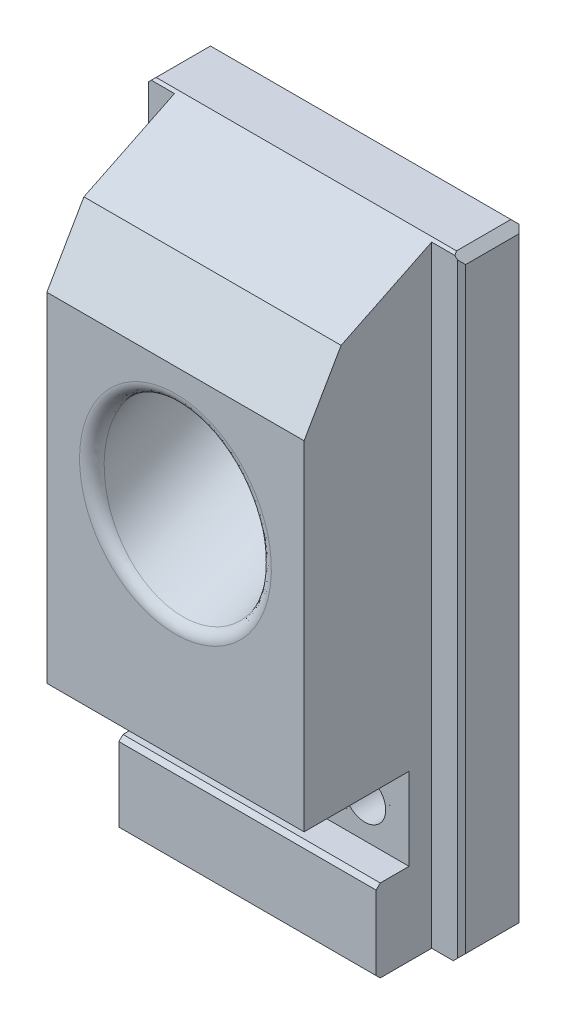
ISO-10303-21;
HEADER;
FILE_DESCRIPTION(('STEP AP214'),'2;1');
FILE_NAME('part.step','',(''),(''),'','','');
FILE_SCHEMA(('AUTOMOTIVE_DESIGN { 1 0 10303 214 1 1 1 1 }'));
ENDSEC;
DATA;
#1=APPLICATION_CONTEXT('core data for automotive mechanical design processes');
#2=APPLICATION_PROTOCOL_DEFINITION('international standard','automotive_design',2000,#1);
#3=PRODUCT_CONTEXT('',#1,'mechanical');
#4=PRODUCT('Part','Part','',(#3));
#5=PRODUCT_RELATED_PRODUCT_CATEGORY('part','',(#4));
#6=PRODUCT_DEFINITION_FORMATION('','',#4);
#7=PRODUCT_DEFINITION_CONTEXT('part definition',#1,'design');
#8=PRODUCT_DEFINITION('design','',#6,#7);
#9=PRODUCT_DEFINITION_SHAPE('','',#8);
#10=(LENGTH_UNIT() NAMED_UNIT(*) SI_UNIT(.MILLI.,.METRE.));
#11=(NAMED_UNIT(*) PLANE_ANGLE_UNIT() SI_UNIT($,.RADIAN.));
#12=(NAMED_UNIT(*) SI_UNIT($,.STERADIAN.) SOLID_ANGLE_UNIT());
#13=UNCERTAINTY_MEASURE_WITH_UNIT(LENGTH_MEASURE(1.E-05),#10,'distance_accuracy_value','');
#14=(GEOMETRIC_REPRESENTATION_CONTEXT(3) GLOBAL_UNCERTAINTY_ASSIGNED_CONTEXT((#13)) GLOBAL_UNIT_ASSIGNED_CONTEXT((#10,
#11,#12)) REPRESENTATION_CONTEXT('',''));
#15=CARTESIAN_POINT('',(0.,0.,0.));
#16=DIRECTION('',(0.,0.,1.));
#17=DIRECTION('',(1.,0.,0.));
#18=AXIS2_PLACEMENT_3D('',#15,#16,#17);
#19=CARTESIAN_POINT('',(-9.779,37.846,-11.684));
#20=DIRECTION('',(0.,0.,-1.));
#21=DIRECTION('',(-1.,0.,0.));
#22=AXIS2_PLACEMENT_3D('',#19,#20,#21);
#23=PLANE('',#22);
#24=DIRECTION('',(1.,0.,0.));
#25=VECTOR('',#24,1.);
#26=CARTESIAN_POINT('',(9.271,37.592,-11.684));
#27=LINE('',#26,#25);
#28=CARTESIAN_POINT('',(-9.525,37.592,-11.684));
#29=VERTEX_POINT('',#28);
#30=CARTESIAN_POINT('',(9.525,37.592,-11.684));
#31=VERTEX_POINT('',#30);
#32=EDGE_CURVE('E533',#29,#31,#27,.T.);
#33=ORIENTED_EDGE('',*,*,#32,.T.);
#34=DIRECTION('',(0.,-1.,0.));
#35=VECTOR('',#34,1.);
#36=CARTESIAN_POINT('',(9.525,37.846,-11.684));
#37=LINE('',#36,#35);
#38=CARTESIAN_POINT('',(9.525,0.254,-11.684));
#39=VERTEX_POINT('',#38);
#40=EDGE_CURVE('E824',#31,#39,#37,.T.);
#41=ORIENTED_EDGE('',*,*,#40,.T.);
#42=DIRECTION('',(-1.,0.,0.));
#43=VECTOR('',#42,1.);
#44=CARTESIAN_POINT('',(-9.779,0.254,-11.684));
#45=LINE('',#44,#43);
#46=CARTESIAN_POINT('',(-9.525,0.254000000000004,-11.684));
#47=VERTEX_POINT('',#46);
#48=EDGE_CURVE('E567',#39,#47,#45,.T.);
#49=ORIENTED_EDGE('',*,*,#48,.T.);
#50=DIRECTION('',(0.,1.,0.));
#51=VECTOR('',#50,1.);
#52=CARTESIAN_POINT('',(-9.525,37.846,-11.684));
#53=LINE('',#52,#51);
#54=EDGE_CURVE('E771',#47,#29,#53,.T.);
#55=ORIENTED_EDGE('',*,*,#54,.T.);
#56=EDGE_LOOP('',(#33,#41,#49,#55));
#57=FACE_BOUND('',#56,.T.);
#58=CARTESIAN_POINT('',(5.207,7.366,-11.684));
#59=DIRECTION('',(0.,0.,-1.));
#60=DIRECTION('',(-1.,0.,0.));
#61=AXIS2_PLACEMENT_3D('',#58,#59,#60);
#62=CIRCLE('',#61,1.28905);
#63=CARTESIAN_POINT('',(3.91795,7.366,-11.684));
#64=VERTEX_POINT('',#63);
#65=EDGE_CURVE('E391',#64,#64,#62,.T.);
#66=ORIENTED_EDGE('',*,*,#65,.F.);
#67=EDGE_LOOP('',(#66));
#68=FACE_BOUND('',#67,.T.);
#69=DIRECTION('',(1.,0.,0.));
#70=VECTOR('',#69,1.);
#71=CARTESIAN_POINT('',(4.21694967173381,6.5405,-11.684));
#72=LINE('',#71,#70);
#73=CARTESIAN_POINT('',(3.85071370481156,6.5405,-11.684));
#74=VERTEX_POINT('',#73);
#75=CARTESIAN_POINT('',(3.85101106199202,6.5405,-11.684));
#76=VERTEX_POINT('',#75);
#77=EDGE_CURVE('E316',#74,#76,#72,.T.);
#78=ORIENTED_EDGE('',*,*,#77,.T.);
#79=CARTESIAN_POINT('',(5.207,7.366,-11.684));
#80=DIRECTION('',(0.,0.,-1.));
#81=DIRECTION('',(-1.,0.,0.));
#82=AXIS2_PLACEMENT_3D('',#79,#80,#81);
#83=CIRCLE('',#82,1.5875);
#84=CARTESIAN_POINT('',(6.7945,7.366,-11.684));
#85=VERTEX_POINT('',#84);
#86=EDGE_CURVE('E652',#76,#85,#83,.T.);
#87=ORIENTED_EDGE('',*,*,#86,.T.);
#88=DIRECTION('',(-1.,0.,0.));
#89=VECTOR('',#88,1.);
#90=CARTESIAN_POINT('',(-9.779,7.366,-11.684));
#91=LINE('',#90,#89);
#92=CARTESIAN_POINT('',(6.794754,7.366,-11.684));
#93=VERTEX_POINT('',#92);
#94=EDGE_CURVE('E579',#85,#93,#91,.F.);
#95=ORIENTED_EDGE('',*,*,#94,.T.);
#96=CARTESIAN_POINT('',(5.207,7.366,-11.684));
#97=DIRECTION('',(0.,0.,-1.));
#98=DIRECTION('',(-1.,0.,0.));
#99=AXIS2_PLACEMENT_3D('',#96,#97,#98);
#100=CIRCLE('',#99,1.587754);
#101=EDGE_CURVE('E649',#74,#93,#100,.T.);
#102=ORIENTED_EDGE('',*,*,#101,.F.);
#103=EDGE_LOOP('',(#78,#87,#95,#102));
#104=FACE_BOUND('',#103,.T.);
#105=CARTESIAN_POINT('',(-5.207,7.366,-11.684));
#106=DIRECTION('',(0.,0.,-1.));
#107=DIRECTION('',(-1.,0.,0.));
#108=AXIS2_PLACEMENT_3D('',#105,#106,#107);
#109=CIRCLE('',#108,1.28905);
#110=CARTESIAN_POINT('',(-6.49605,7.366,-11.684));
#111=VERTEX_POINT('',#110);
#112=EDGE_CURVE('E335',#111,#111,#109,.T.);
#113=ORIENTED_EDGE('',*,*,#112,.F.);
#114=EDGE_LOOP('',(#113));
#115=FACE_BOUND('',#114,.T.);
#116=DIRECTION('',(1.,0.,0.));
#117=VECTOR('',#116,1.);
#118=CARTESIAN_POINT('',(-6.19705032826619,6.5405,-11.684));
#119=LINE('',#118,#117);
#120=CARTESIAN_POINT('',(-6.56328629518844,6.5405,-11.684));
#121=VERTEX_POINT('',#120);
#122=CARTESIAN_POINT('',(-6.56298893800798,6.5405,-11.684));
#123=VERTEX_POINT('',#122);
#124=EDGE_CURVE('E300',#121,#123,#119,.T.);
#125=ORIENTED_EDGE('',*,*,#124,.T.);
#126=CARTESIAN_POINT('',(-5.207,7.366,-11.684));
#127=DIRECTION('',(0.,0.,-1.));
#128=DIRECTION('',(-1.,0.,0.));
#129=AXIS2_PLACEMENT_3D('',#126,#127,#128);
#130=CIRCLE('',#129,1.5875);
#131=CARTESIAN_POINT('',(-3.6195,7.366,-11.684));
#132=VERTEX_POINT('',#131);
#133=EDGE_CURVE('E314',#123,#132,#130,.T.);
#134=ORIENTED_EDGE('',*,*,#133,.T.);
#135=DIRECTION('',(-1.,0.,0.));
#136=VECTOR('',#135,1.);
#137=CARTESIAN_POINT('',(-9.779,7.366,-11.684));
#138=LINE('',#137,#136);
#139=CARTESIAN_POINT('',(-3.619246,7.366,-11.684));
#140=VERTEX_POINT('',#139);
#141=EDGE_CURVE('E574',#132,#140,#138,.F.);
#142=ORIENTED_EDGE('',*,*,#141,.T.);
#143=CARTESIAN_POINT('',(-5.207,7.366,-11.684));
#144=DIRECTION('',(0.,0.,-1.));
#145=DIRECTION('',(-1.,0.,0.));
#146=AXIS2_PLACEMENT_3D('',#143,#144,#145);
#147=CIRCLE('',#146,1.587754);
#148=EDGE_CURVE('E315',#121,#140,#147,.T.);
#149=ORIENTED_EDGE('',*,*,#148,.F.);
#150=EDGE_LOOP('',(#125,#134,#142,#149));
#151=FACE_BOUND('',#150,.T.);
#152=DIRECTION('',(1.,0.,0.));
#153=VECTOR('',#152,1.);
#154=CARTESIAN_POINT('',(9.779,6.5405,-11.684));
#155=LINE('',#154,#153);
#156=CARTESIAN_POINT('',(6.56298893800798,6.5405,-11.684));
#157=VERTEX_POINT('',#156);
#158=CARTESIAN_POINT('',(6.56328629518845,6.5405,-11.684));
#159=VERTEX_POINT('',#158);
#160=EDGE_CURVE('E619',#157,#159,#155,.T.);
#161=ORIENTED_EDGE('',*,*,#160,.T.);
#162=CARTESIAN_POINT('',(6.79475384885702,7.36530721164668,-11.684));
#163=VERTEX_POINT('',#162);
#164=EDGE_CURVE('E595',#163,#159,#100,.T.);
#165=ORIENTED_EDGE('',*,*,#164,.F.);
#166=DIRECTION('',(-0.999999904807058,0.000436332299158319,0.));
#167=VECTOR('',#166,1.);
#168=CARTESIAN_POINT('',(-9.79229655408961,7.37254467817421,-11.684));
#169=LINE('',#168,#167);
#170=CARTESIAN_POINT('',(6.7944998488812,7.36530732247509,-11.684));
#171=VERTEX_POINT('',#170);
#172=EDGE_CURVE('E582',#163,#171,#169,.T.);
#173=ORIENTED_EDGE('',*,*,#172,.T.);
#174=EDGE_CURVE('E655',#171,#157,#83,.T.);
#175=ORIENTED_EDGE('',*,*,#174,.T.);
#176=EDGE_LOOP('',(#161,#165,#173,#175));
#177=FACE_BOUND('',#176,.T.);
#178=CARTESIAN_POINT('',(-3.85101106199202,6.5405,-11.684));
#179=VERTEX_POINT('',#178);
#180=CARTESIAN_POINT('',(-3.85071370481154,6.5405,-11.684));
#181=VERTEX_POINT('',#180);
#182=EDGE_CURVE('E618',#179,#181,#72,.T.);
#183=ORIENTED_EDGE('',*,*,#182,.T.);
#184=CARTESIAN_POINT('',(-3.61924615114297,7.36530721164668,-11.684));
#185=VERTEX_POINT('',#184);
#186=EDGE_CURVE('E324',#185,#181,#147,.T.);
#187=ORIENTED_EDGE('',*,*,#186,.F.);
#188=DIRECTION('',(-0.999999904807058,0.000436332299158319,0.));
#189=VECTOR('',#188,1.);
#190=CARTESIAN_POINT('',(-9.79229853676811,7.36800071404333,-11.684));
#191=LINE('',#190,#189);
#192=CARTESIAN_POINT('',(-3.6195001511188,7.36530732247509,-11.684));
#193=VERTEX_POINT('',#192);
#194=EDGE_CURVE('E576',#185,#193,#191,.T.);
#195=ORIENTED_EDGE('',*,*,#194,.T.);
#196=EDGE_CURVE('E323',#193,#179,#130,.T.);
#197=ORIENTED_EDGE('',*,*,#196,.T.);
#198=EDGE_LOOP('',(#183,#187,#195,#197));
#199=FACE_BOUND('',#198,.T.);
#200=CARTESIAN_POINT('',(0.,27.4949533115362,-11.684));
#201=DIRECTION('',(0.,0.,-1.));
#202=DIRECTION('',(0.,-1.,0.));
#203=AXIS2_PLACEMENT_3D('',#200,#201,#202);
#204=ELLIPSE('',#203,6.42929798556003,5.9182);
#205=CARTESIAN_POINT('',(0.,21.0656553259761,-11.684));
#206=VERTEX_POINT('',#205);
#207=EDGE_CURVE('E422',#206,#206,#204,.F.);
#208=ORIENTED_EDGE('',*,*,#207,.T.);
#209=EDGE_LOOP('',(#208));
#210=FACE_BOUND('',#209,.T.);
#211=ADVANCED_FACE('F39',(#57,#68,#104,#115,#151,#177,#199,#210),#23,.T.);
#212=CARTESIAN_POINT('',(90.3966225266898,10.16,-6.477));
#213=DIRECTION('',(0.,0.,-1.));
#214=DIRECTION('',(-1.,0.,0.));
#215=AXIS2_PLACEMENT_3D('',#212,#213,#214);
#216=PLANE('',#215);
#217=CARTESIAN_POINT('',(-5.207,7.366,-6.477));
#218=DIRECTION('',(0.,0.,1.));
#219=DIRECTION('',(1.,0.,0.));
#220=AXIS2_PLACEMENT_3D('',#217,#218,#219);
#221=CIRCLE('',#220,1.587754);
#222=CARTESIAN_POINT('',(-3.619246,7.366,-6.477));
#223=VERTEX_POINT('',#222);
#224=CARTESIAN_POINT('',(-3.61924615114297,7.36530721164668,-6.477));
#225=VERTEX_POINT('',#224);
#226=EDGE_CURVE('E659',#223,#225,#221,.T.);
#227=ORIENTED_EDGE('',*,*,#226,.F.);
#228=DIRECTION('',(1.,0.,0.));
#229=VECTOR('',#228,1.);
#230=CARTESIAN_POINT('',(-3.6195,7.366,-6.477));
#231=LINE('',#230,#229);
#232=CARTESIAN_POINT('',(-3.6195,7.366,-6.477));
#233=VERTEX_POINT('',#232);
#234=EDGE_CURVE('E672',#223,#233,#231,.F.);
#235=ORIENTED_EDGE('',*,*,#234,.T.);
#236=CARTESIAN_POINT('',(-5.207,7.366,-6.477));
#237=DIRECTION('',(0.,0.,1.));
#238=DIRECTION('',(1.,0.,0.));
#239=AXIS2_PLACEMENT_3D('',#236,#237,#238);
#240=CIRCLE('',#239,1.5875);
#241=CARTESIAN_POINT('',(-3.6195001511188,7.36530732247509,-6.477));
#242=VERTEX_POINT('',#241);
#243=EDGE_CURVE('E667',#233,#242,#240,.T.);
#244=ORIENTED_EDGE('',*,*,#243,.T.);
#245=DIRECTION('',(0.999999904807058,-0.000436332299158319,0.));
#246=VECTOR('',#245,1.);
#247=CARTESIAN_POINT('',(-3.6195001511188,7.36530732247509,-6.477));
#248=LINE('',#247,#246);
#249=EDGE_CURVE('E669',#225,#242,#248,.F.);
#250=ORIENTED_EDGE('',*,*,#249,.F.);
#251=EDGE_LOOP('',(#227,#235,#244,#250));
#252=FACE_BOUND('',#251,.T.);
#253=CARTESIAN_POINT('',(5.207,7.366,-6.477));
#254=DIRECTION('',(0.,0.,-1.));
#255=DIRECTION('',(-1.,0.,0.));
#256=AXIS2_PLACEMENT_3D('',#253,#254,#255);
#257=CIRCLE('',#256,1.28905);
#258=CARTESIAN_POINT('',(3.91795,7.366,-6.477));
#259=VERTEX_POINT('',#258);
#260=EDGE_CURVE('E327',#259,#259,#257,.T.);
#261=ORIENTED_EDGE('',*,*,#260,.T.);
#262=EDGE_LOOP('',(#261));
#263=FACE_BOUND('',#262,.T.);
#264=CARTESIAN_POINT('',(-5.207,7.366,-6.477));
#265=DIRECTION('',(0.,0.,-1.));
#266=DIRECTION('',(-1.,0.,0.));
#267=AXIS2_PLACEMENT_3D('',#264,#265,#266);
#268=CIRCLE('',#267,1.28905);
#269=CARTESIAN_POINT('',(-6.49605,7.366,-6.477));
#270=VERTEX_POINT('',#269);
#271=EDGE_CURVE('E388',#270,#270,#268,.T.);
#272=ORIENTED_EDGE('',*,*,#271,.T.);
#273=EDGE_LOOP('',(#272));
#274=FACE_BOUND('',#273,.T.);
#275=DIRECTION('',(-1.,0.,0.));
#276=VECTOR('',#275,1.);
#277=CARTESIAN_POINT('',(90.3966225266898,10.16,-6.477));
#278=LINE('',#277,#276);
#279=CARTESIAN_POINT('',(7.9375,10.16,-6.477));
#280=VERTEX_POINT('',#279);
#281=CARTESIAN_POINT('',(-7.9375,10.16,-6.477));
#282=VERTEX_POINT('',#281);
#283=EDGE_CURVE('E334',#280,#282,#278,.T.);
#284=ORIENTED_EDGE('',*,*,#283,.T.);
#285=DIRECTION('',(0.,-1.,0.));
#286=VECTOR('',#285,1.);
#287=CARTESIAN_POINT('',(-7.9375,37.846,-6.477));
#288=LINE('',#287,#286);
#289=CARTESIAN_POINT('',(-7.9375,5.08,-6.477));
#290=VERTEX_POINT('',#289);
#291=EDGE_CURVE('E356',#282,#290,#288,.T.);
#292=ORIENTED_EDGE('',*,*,#291,.T.);
#293=DIRECTION('',(-1.,0.,0.));
#294=VECTOR('',#293,1.);
#295=CARTESIAN_POINT('',(90.3966225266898,5.08,-6.477));
#296=LINE('',#295,#294);
#297=CARTESIAN_POINT('',(7.9375,5.08,-6.477));
#298=VERTEX_POINT('',#297);
#299=EDGE_CURVE('E331',#298,#290,#296,.T.);
#300=ORIENTED_EDGE('',*,*,#299,.F.);
#301=DIRECTION('',(0.,1.,0.));
#302=VECTOR('',#301,1.);
#303=CARTESIAN_POINT('',(7.9375,37.846,-6.477));
#304=LINE('',#303,#302);
#305=EDGE_CURVE('E380',#298,#280,#304,.T.);
#306=ORIENTED_EDGE('',*,*,#305,.T.);
#307=EDGE_LOOP('',(#284,#292,#300,#306));
#308=FACE_BOUND('',#307,.T.);
#309=CARTESIAN_POINT('',(5.207,7.366,-6.477));
#310=DIRECTION('',(0.,0.,1.));
#311=DIRECTION('',(1.,0.,0.));
#312=AXIS2_PLACEMENT_3D('',#309,#310,#311);
#313=CIRCLE('',#312,1.587754);
#314=CARTESIAN_POINT('',(6.794754,7.366,-6.477));
#315=VERTEX_POINT('',#314);
#316=CARTESIAN_POINT('',(6.79475384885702,7.36530721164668,-6.477));
#317=VERTEX_POINT('',#316);
#318=EDGE_CURVE('E631',#315,#317,#313,.T.);
#319=ORIENTED_EDGE('',*,*,#318,.F.);
#320=DIRECTION('',(1.,0.,0.));
#321=VECTOR('',#320,1.);
#322=CARTESIAN_POINT('',(6.7945,7.366,-6.477));
#323=LINE('',#322,#321);
#324=CARTESIAN_POINT('',(6.7945,7.366,-6.477));
#325=VERTEX_POINT('',#324);
#326=EDGE_CURVE('E646',#315,#325,#323,.F.);
#327=ORIENTED_EDGE('',*,*,#326,.T.);
#328=CARTESIAN_POINT('',(5.207,7.366,-6.477));
#329=DIRECTION('',(0.,0.,1.));
#330=DIRECTION('',(1.,0.,0.));
#331=AXIS2_PLACEMENT_3D('',#328,#329,#330);
#332=CIRCLE('',#331,1.5875);
#333=CARTESIAN_POINT('',(6.7944998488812,7.36530732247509,-6.477));
#334=VERTEX_POINT('',#333);
#335=EDGE_CURVE('E639',#325,#334,#332,.T.);
#336=ORIENTED_EDGE('',*,*,#335,.T.);
#337=DIRECTION('',(0.999999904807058,-0.000436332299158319,0.));
#338=VECTOR('',#337,1.);
#339=CARTESIAN_POINT('',(6.7944998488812,7.36530732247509,-6.477));
#340=LINE('',#339,#338);
#341=EDGE_CURVE('E643',#317,#334,#340,.F.);
#342=ORIENTED_EDGE('',*,*,#341,.F.);
#343=EDGE_LOOP('',(#319,#327,#336,#342));
#344=FACE_BOUND('',#343,.T.);
#345=ADVANCED_FACE('F461',(#252,#263,#274,#308,#344),#216,.F.);
#346=CARTESIAN_POINT('',(-9.779,37.846,-7.85876));
#347=DIRECTION('',(-1.,0.,0.));
#348=DIRECTION('',(0.,0.,1.));
#349=AXIS2_PLACEMENT_3D('',#346,#347,#348);
#350=PLANE('',#349);
#351=DIRECTION('',(0.,-1.,0.));
#352=VECTOR('',#351,1.);
#353=CARTESIAN_POINT('',(-9.779,37.846,-11.43));
#354=LINE('',#353,#352);
#355=CARTESIAN_POINT('',(-9.779,37.338,-11.43));
#356=VERTEX_POINT('',#355);
#357=CARTESIAN_POINT('',(-9.779,0.508,-11.43));
#358=VERTEX_POINT('',#357);
#359=EDGE_CURVE('E772',#356,#358,#354,.T.);
#360=ORIENTED_EDGE('',*,*,#359,.T.);
#361=DIRECTION('',(0.,0.,1.));
#362=VECTOR('',#361,1.);
#363=CARTESIAN_POINT('',(-9.779,0.508,-7.85876));
#364=LINE('',#363,#362);
#365=CARTESIAN_POINT('',(-9.779,0.508,-8.128));
#366=VERTEX_POINT('',#365);
#367=EDGE_CURVE('E751',#358,#366,#364,.T.);
#368=ORIENTED_EDGE('',*,*,#367,.T.);
#369=DIRECTION('',(0.,1.,0.));
#370=VECTOR('',#369,1.);
#371=CARTESIAN_POINT('',(-9.779,37.846,-8.128));
#372=LINE('',#371,#370);
#373=CARTESIAN_POINT('',(-9.779,37.338,-8.128));
#374=VERTEX_POINT('',#373);
#375=EDGE_CURVE('E817',#366,#374,#372,.T.);
#376=ORIENTED_EDGE('',*,*,#375,.T.);
#377=DIRECTION('',(0.,0.,-1.));
#378=VECTOR('',#377,1.);
#379=CARTESIAN_POINT('',(-9.779,37.338,-11.684));
#380=LINE('',#379,#378);
#381=EDGE_CURVE('E804',#374,#356,#380,.T.);
#382=ORIENTED_EDGE('',*,*,#381,.T.);
#383=EDGE_LOOP('',(#360,#368,#376,#382));
#384=FACE_BOUND('',#383,.T.);
#385=ADVANCED_FACE('F469',(#384),#350,.T.);
#386=CARTESIAN_POINT('',(9.779,37.846,-11.684));
#387=DIRECTION('',(1.,0.,0.));
#388=DIRECTION('',(0.,0.,-1.));
#389=AXIS2_PLACEMENT_3D('',#386,#387,#388);
#390=PLANE('',#389);
#391=DIRECTION('',(0.,1.,0.));
#392=VECTOR('',#391,1.);
#393=CARTESIAN_POINT('',(9.779,37.846,-11.43));
#394=LINE('',#393,#392);
#395=CARTESIAN_POINT('',(9.779,0.508,-11.43));
#396=VERTEX_POINT('',#395);
#397=CARTESIAN_POINT('',(9.779,37.338,-11.43));
#398=VERTEX_POINT('',#397);
#399=EDGE_CURVE('E783',#396,#398,#394,.T.);
#400=ORIENTED_EDGE('',*,*,#399,.T.);
#401=DIRECTION('',(0.,0.,1.));
#402=VECTOR('',#401,1.);
#403=CARTESIAN_POINT('',(9.779,37.338,-8.07359027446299));
#404=LINE('',#403,#402);
#405=CARTESIAN_POINT('',(9.779,37.338,-8.128));
#406=VERTEX_POINT('',#405);
#407=EDGE_CURVE('E524',#398,#406,#404,.T.);
#408=ORIENTED_EDGE('',*,*,#407,.T.);
#409=DIRECTION('',(0.,-1.,0.));
#410=VECTOR('',#409,1.);
#411=CARTESIAN_POINT('',(9.779,37.846,-8.128));
#412=LINE('',#411,#410);
#413=CARTESIAN_POINT('',(9.779,0.508,-8.128));
#414=VERTEX_POINT('',#413);
#415=EDGE_CURVE('E776',#406,#414,#412,.T.);
#416=ORIENTED_EDGE('',*,*,#415,.T.);
#417=DIRECTION('',(0.,0.,-1.));
#418=VECTOR('',#417,1.);
#419=CARTESIAN_POINT('',(9.779,0.508,-11.684));
#420=LINE('',#419,#418);
#421=EDGE_CURVE('E418',#414,#396,#420,.T.);
#422=ORIENTED_EDGE('',*,*,#421,.T.);
#423=EDGE_LOOP('',(#400,#408,#416,#422));
#424=FACE_BOUND('',#423,.T.);
#425=ADVANCED_FACE('F476',(#424),#390,.T.);
#426=CARTESIAN_POINT('',(7.9375,37.846,-7.85876));
#427=DIRECTION('',(0.,-1.,0.));
#428=DIRECTION('',(0.,0.,-1.));
#429=AXIS2_PLACEMENT_3D('',#426,#427,#428);
#430=PLANE('',#429);
#431=DIRECTION('',(0.,0.,-1.));
#432=VECTOR('',#431,1.);
#433=CARTESIAN_POINT('',(9.271,37.846,-11.684));
#434=LINE('',#433,#432);
#435=CARTESIAN_POINT('',(9.271,37.846,-8.07359027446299));
#436=VERTEX_POINT('',#435);
#437=CARTESIAN_POINT('',(9.271,37.846,-11.43));
#438=VERTEX_POINT('',#437);
#439=EDGE_CURVE('E746',#436,#438,#434,.T.);
#440=ORIENTED_EDGE('',*,*,#439,.T.);
#441=DIRECTION('',(-1.,0.,0.));
#442=VECTOR('',#441,1.);
#443=CARTESIAN_POINT('',(-9.271,37.846,-11.43));
#444=LINE('',#443,#442);
#445=CARTESIAN_POINT('',(-9.271,37.846,-11.43));
#446=VERTEX_POINT('',#445);
#447=EDGE_CURVE('E542',#438,#446,#444,.T.);
#448=ORIENTED_EDGE('',*,*,#447,.T.);
#449=DIRECTION('',(0.,0.,1.));
#450=VECTOR('',#449,1.);
#451=CARTESIAN_POINT('',(-9.271,37.846,-8.07359027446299));
#452=LINE('',#451,#450);
#453=CARTESIAN_POINT('',(-9.271,37.846,-8.07359027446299));
#454=VERTEX_POINT('',#453);
#455=EDGE_CURVE('E752',#446,#454,#452,.T.);
#456=ORIENTED_EDGE('',*,*,#455,.T.);
#457=DIRECTION('',(-1.,0.,0.));
#458=VECTOR('',#457,1.);
#459=CARTESIAN_POINT('',(90.3966225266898,37.846,-8.07359027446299));
#460=LINE('',#459,#458);
#461=EDGE_CURVE('E341',#436,#454,#460,.T.);
#462=ORIENTED_EDGE('',*,*,#461,.F.);
#463=EDGE_LOOP('',(#440,#448,#456,#462));
#464=FACE_BOUND('',#463,.T.);
#465=ADVANCED_FACE('F504',(#464),#430,.F.);
#466=CARTESIAN_POINT('',(-7.9375,37.846,-7.874));
#467=DIRECTION('',(0.,0.,1.));
#468=DIRECTION('',(1.,0.,0.));
#469=AXIS2_PLACEMENT_3D('',#466,#467,#468);
#470=PLANE('',#469);
#471=DIRECTION('',(-0.707106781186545,-0.70710678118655,0.));
#472=VECTOR('',#471,1.);
#473=CARTESIAN_POINT('',(-8.60425,38.51275,-7.874));
#474=LINE('',#473,#472);
#475=CARTESIAN_POINT('',(-9.3683466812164,37.7486533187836,-7.874));
#476=VERTEX_POINT('',#475);
#477=CARTESIAN_POINT('',(-9.525,37.592,-7.874));
#478=VERTEX_POINT('',#477);
#479=EDGE_CURVE('E808',#476,#478,#474,.T.);
#480=ORIENTED_EDGE('',*,*,#479,.T.);
#481=DIRECTION('',(0.,-1.,0.));
#482=VECTOR('',#481,1.);
#483=CARTESIAN_POINT('',(-9.525,37.846,-7.874));
#484=LINE('',#483,#482);
#485=CARTESIAN_POINT('',(-9.525,0.254000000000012,-7.874));
#486=VERTEX_POINT('',#485);
#487=EDGE_CURVE('E774',#478,#486,#484,.T.);
#488=ORIENTED_EDGE('',*,*,#487,.T.);
#489=DIRECTION('',(-0.707106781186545,0.70710678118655,0.));
#490=VECTOR('',#489,1.);
#491=CARTESIAN_POINT('',(-27.52725,18.25625,-7.874));
#492=LINE('',#491,#490);
#493=CARTESIAN_POINT('',(-9.271,0.,-7.874));
#494=VERTEX_POINT('',#493);
#495=EDGE_CURVE('E806',#486,#494,#492,.F.);
#496=ORIENTED_EDGE('',*,*,#495,.T.);
#497=DIRECTION('',(-1.,0.,0.));
#498=VECTOR('',#497,1.);
#499=CARTESIAN_POINT('',(7.9375,0.,-7.874));
#500=LINE('',#499,#498);
#501=CARTESIAN_POINT('',(-7.9375,0.,-7.874));
#502=VERTEX_POINT('',#501);
#503=EDGE_CURVE('E366',#502,#494,#500,.T.);
#504=ORIENTED_EDGE('',*,*,#503,.F.);
#505=DIRECTION('',(0.,-1.,0.));
#506=VECTOR('',#505,1.);
#507=CARTESIAN_POINT('',(-7.9375,37.846,-7.874));
#508=LINE('',#507,#506);
#509=CARTESIAN_POINT('',(-7.9375,37.7486533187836,-7.874));
#510=VERTEX_POINT('',#509);
#511=EDGE_CURVE('E373',#510,#502,#508,.T.);
#512=ORIENTED_EDGE('',*,*,#511,.F.);
#513=DIRECTION('',(1.,0.,0.));
#514=VECTOR('',#513,1.);
#515=CARTESIAN_POINT('',(-7.9375,37.7486533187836,-7.874));
#516=LINE('',#515,#514);
#517=EDGE_CURVE('E363',#476,#510,#516,.T.);
#518=ORIENTED_EDGE('',*,*,#517,.F.);
#519=EDGE_LOOP('',(#480,#488,#496,#504,#512,#518));
#520=FACE_BOUND('',#519,.T.);
#521=ADVANCED_FACE('F501',(#520),#470,.T.);
#522=CARTESIAN_POINT('',(7.9375,0.,-7.85876));
#523=DIRECTION('',(0.,-1.,0.));
#524=DIRECTION('',(0.,0.,-1.));
#525=AXIS2_PLACEMENT_3D('',#522,#523,#524);
#526=PLANE('',#525);
#527=DIRECTION('',(0.,0.,1.));
#528=VECTOR('',#527,1.);
#529=CARTESIAN_POINT('',(7.9375,0.,-7.85876));
#530=LINE('',#529,#528);
#531=CARTESIAN_POINT('',(7.9375,0.,-7.874));
#532=VERTEX_POINT('',#531);
#533=CARTESIAN_POINT('',(7.9375,0.,-4.699));
#534=VERTEX_POINT('',#533);
#535=EDGE_CURVE('E367',#532,#534,#530,.T.);
#536=ORIENTED_EDGE('',*,*,#535,.T.);
#537=DIRECTION('',(-1.,0.,0.));
#538=VECTOR('',#537,1.);
#539=CARTESIAN_POINT('',(-7.9375,0.,-4.699));
#540=LINE('',#539,#538);
#541=CARTESIAN_POINT('',(-7.9375,0.,-4.699));
#542=VERTEX_POINT('',#541);
#543=EDGE_CURVE('E564',#534,#542,#540,.T.);
#544=ORIENTED_EDGE('',*,*,#543,.T.);
#545=DIRECTION('',(0.,0.,-1.));
#546=VECTOR('',#545,1.);
#547=CARTESIAN_POINT('',(-7.9375,0.,0.));
#548=LINE('',#547,#546);
#549=EDGE_CURVE('E364',#542,#502,#548,.T.);
#550=ORIENTED_EDGE('',*,*,#549,.T.);
#551=ORIENTED_EDGE('',*,*,#503,.T.);
#552=DIRECTION('',(0.,0.,-1.));
#553=VECTOR('',#552,1.);
#554=CARTESIAN_POINT('',(-9.271,0.,-7.85876));
#555=LINE('',#554,#553);
#556=CARTESIAN_POINT('',(-9.271,0.,-11.43));
#557=VERTEX_POINT('',#556);
#558=EDGE_CURVE('E813',#494,#557,#555,.T.);
#559=ORIENTED_EDGE('',*,*,#558,.T.);
#560=DIRECTION('',(1.,0.,0.));
#561=VECTOR('',#560,1.);
#562=CARTESIAN_POINT('',(7.9375,0.,-11.43));
#563=LINE('',#562,#561);
#564=CARTESIAN_POINT('',(9.271,0.,-11.43));
#565=VERTEX_POINT('',#564);
#566=EDGE_CURVE('E562',#557,#565,#563,.T.);
#567=ORIENTED_EDGE('',*,*,#566,.T.);
#568=DIRECTION('',(0.,0.,1.));
#569=VECTOR('',#568,1.);
#570=CARTESIAN_POINT('',(9.271,0.,-7.85876));
#571=LINE('',#570,#569);
#572=CARTESIAN_POINT('',(9.271,0.,-7.874));
#573=VERTEX_POINT('',#572);
#574=EDGE_CURVE('E811',#565,#573,#571,.T.);
#575=ORIENTED_EDGE('',*,*,#574,.T.);
#576=DIRECTION('',(-1.,0.,0.));
#577=VECTOR('',#576,1.);
#578=CARTESIAN_POINT('',(7.9375,0.,-7.874));
#579=LINE('',#578,#577);
#580=EDGE_CURVE('E402',#573,#532,#579,.T.);
#581=ORIENTED_EDGE('',*,*,#580,.T.);
#582=EDGE_LOOP('',(#536,#544,#550,#551,#559,#567,#575,#581));
#583=FACE_BOUND('',#582,.T.);
#584=ADVANCED_FACE('F503',(#583),#526,.T.);
#585=CARTESIAN_POINT('',(9.779,37.846,-7.874));
#586=DIRECTION('',(0.,0.,1.));
#587=DIRECTION('',(1.,0.,0.));
#588=AXIS2_PLACEMENT_3D('',#585,#586,#587);
#589=PLANE('',#588);
#590=DIRECTION('',(-0.707106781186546,-0.707106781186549,0.));
#591=VECTOR('',#590,1.);
#592=CARTESIAN_POINT('',(28.448,19.177,-7.874));
#593=LINE('',#592,#591);
#594=CARTESIAN_POINT('',(9.525,0.253999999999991,-7.874));
#595=VERTEX_POINT('',#594);
#596=EDGE_CURVE('E517',#573,#595,#593,.F.);
#597=ORIENTED_EDGE('',*,*,#596,.T.);
#598=DIRECTION('',(0.,1.,0.));
#599=VECTOR('',#598,1.);
#600=CARTESIAN_POINT('',(9.525,37.846,-7.874));
#601=LINE('',#600,#599);
#602=CARTESIAN_POINT('',(9.525,37.592,-7.874));
#603=VERTEX_POINT('',#602);
#604=EDGE_CURVE('E519',#595,#603,#601,.T.);
#605=ORIENTED_EDGE('',*,*,#604,.T.);
#606=DIRECTION('',(-0.707106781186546,0.707106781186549,0.));
#607=VECTOR('',#606,1.);
#608=CARTESIAN_POINT('',(9.525,37.592,-7.874));
#609=LINE('',#608,#607);
#610=CARTESIAN_POINT('',(9.3683466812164,37.7486533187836,-7.874));
#611=VERTEX_POINT('',#610);
#612=EDGE_CURVE('E523',#603,#611,#609,.T.);
#613=ORIENTED_EDGE('',*,*,#612,.T.);
#614=DIRECTION('',(1.,0.,0.));
#615=VECTOR('',#614,1.);
#616=CARTESIAN_POINT('',(9.779,37.7486533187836,-7.874));
#617=LINE('',#616,#615);
#618=CARTESIAN_POINT('',(7.9375,37.7486533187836,-7.874));
#619=VERTEX_POINT('',#618);
#620=EDGE_CURVE('E359',#619,#611,#617,.T.);
#621=ORIENTED_EDGE('',*,*,#620,.F.);
#622=DIRECTION('',(0.,-1.,0.));
#623=VECTOR('',#622,1.);
#624=CARTESIAN_POINT('',(7.9375,37.846,-7.874));
#625=LINE('',#624,#623);
#626=EDGE_CURVE('E399',#619,#532,#625,.T.);
#627=ORIENTED_EDGE('',*,*,#626,.T.);
#628=ORIENTED_EDGE('',*,*,#580,.F.);
#629=EDGE_LOOP('',(#597,#605,#613,#621,#627,#628));
#630=FACE_BOUND('',#629,.T.);
#631=ADVANCED_FACE('F484',(#630),#589,.T.);
#632=CARTESIAN_POINT('',(-7.9375,37.846,0.));
#633=DIRECTION('',(-1.,0.,0.));
#634=DIRECTION('',(0.,0.,1.));
#635=AXIS2_PLACEMENT_3D('',#632,#633,#634);
#636=PLANE('',#635);
#637=DIRECTION('',(0.,-1.,0.));
#638=VECTOR('',#637,1.);
#639=CARTESIAN_POINT('',(-7.9375,37.846,-4.445));
#640=LINE('',#639,#638);
#641=CARTESIAN_POINT('',(-7.9375,4.826,-4.445));
#642=VERTEX_POINT('',#641);
#643=CARTESIAN_POINT('',(-7.9375,0.254,-4.445));
#644=VERTEX_POINT('',#643);
#645=EDGE_CURVE('E350',#642,#644,#640,.T.);
#646=ORIENTED_EDGE('',*,*,#645,.F.);
#647=DIRECTION('',(0.,-0.707106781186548,0.707106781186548));
#648=VECTOR('',#647,1.);
#649=CARTESIAN_POINT('',(-7.9375,19.1135,-18.7325));
#650=LINE('',#649,#648);
#651=CARTESIAN_POINT('',(-7.9375,5.08,-4.699));
#652=VERTEX_POINT('',#651);
#653=EDGE_CURVE('E560',#642,#652,#650,.F.);
#654=ORIENTED_EDGE('',*,*,#653,.T.);
#655=DIRECTION('',(0.,0.,1.));
#656=VECTOR('',#655,1.);
#657=CARTESIAN_POINT('',(-7.9375,5.08,0.));
#658=LINE('',#657,#656);
#659=EDGE_CURVE('E353',#290,#652,#658,.T.);
#660=ORIENTED_EDGE('',*,*,#659,.F.);
#661=ORIENTED_EDGE('',*,*,#291,.F.);
#662=DIRECTION('',(0.,0.,-1.));
#663=VECTOR('',#662,1.);
#664=CARTESIAN_POINT('',(-7.9375,10.16,0.));
#665=LINE('',#664,#663);
#666=CARTESIAN_POINT('',(-7.9375,10.16,0.));
#667=VERTEX_POINT('',#666);
#668=EDGE_CURVE('E347',#667,#282,#665,.T.);
#669=ORIENTED_EDGE('',*,*,#668,.F.);
#670=DIRECTION('',(0.,-1.,0.));
#671=VECTOR('',#670,1.);
#672=CARTESIAN_POINT('',(-7.9375,37.846,0.));
#673=LINE('',#672,#671);
#674=CARTESIAN_POINT('',(-7.9375,31.06547,0.));
#675=VERTEX_POINT('',#674);
#676=EDGE_CURVE('E370',#675,#667,#673,.T.);
#677=ORIENTED_EDGE('',*,*,#676,.F.);
#678=DIRECTION('',(0.,0.866025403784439,-0.5));
#679=VECTOR('',#678,1.);
#680=CARTESIAN_POINT('',(-7.9375,36.1508675,-2.93605561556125));
#681=LINE('',#680,#679);
#682=CARTESIAN_POINT('',(-7.9375,35.0225237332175,-2.28460603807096));
#683=VERTEX_POINT('',#682);
#684=EDGE_CURVE('E411',#675,#683,#681,.T.);
#685=ORIENTED_EDGE('',*,*,#684,.T.);
#686=DIRECTION('',(0.,-0.438371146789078,0.898794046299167));
#687=VECTOR('',#686,1.);
#688=CARTESIAN_POINT('',(-7.9375,34.6649620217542,-1.55149588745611));
#689=LINE('',#688,#687);
#690=EDGE_CURVE('E360',#510,#683,#689,.T.);
#691=ORIENTED_EDGE('',*,*,#690,.F.);
#692=ORIENTED_EDGE('',*,*,#511,.T.);
#693=ORIENTED_EDGE('',*,*,#549,.F.);
#694=DIRECTION('',(0.,0.707106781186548,0.707106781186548));
#695=VECTOR('',#694,1.);
#696=CARTESIAN_POINT('',(-7.9375,21.2725,16.5735));
#697=LINE('',#696,#695);
#698=EDGE_CURVE('E558',#542,#644,#697,.T.);
#699=ORIENTED_EDGE('',*,*,#698,.T.);
#700=EDGE_LOOP('',(#646,#654,#660,#661,#669,#677,#685,#691,#692,#693,#699));
#701=FACE_BOUND('',#700,.T.);
#702=ADVANCED_FACE('F480',(#701),#636,.T.);
#703=CARTESIAN_POINT('',(7.9375,37.846,-7.85876));
#704=DIRECTION('',(1.,0.,0.));
#705=DIRECTION('',(0.,0.,-1.));
#706=AXIS2_PLACEMENT_3D('',#703,#704,#705);
#707=PLANE('',#706);
#708=DIRECTION('',(0.,0.,-1.));
#709=VECTOR('',#708,1.);
#710=CARTESIAN_POINT('',(7.9375,5.08,-7.85876));
#711=LINE('',#710,#709);
#712=CARTESIAN_POINT('',(7.9375,5.08,-4.699));
#713=VERTEX_POINT('',#712);
#714=EDGE_CURVE('E378',#713,#298,#711,.T.);
#715=ORIENTED_EDGE('',*,*,#714,.F.);
#716=DIRECTION('',(0.,0.707106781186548,-0.707106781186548));
#717=VECTOR('',#716,1.);
#718=CARTESIAN_POINT('',(7.9375,23.04288,-22.66188));
#719=LINE('',#718,#717);
#720=CARTESIAN_POINT('',(7.9375,4.826,-4.445));
#721=VERTEX_POINT('',#720);
#722=EDGE_CURVE('E552',#713,#721,#719,.F.);
#723=ORIENTED_EDGE('',*,*,#722,.T.);
#724=DIRECTION('',(0.,1.,0.));
#725=VECTOR('',#724,1.);
#726=CARTESIAN_POINT('',(7.9375,37.846,-4.445));
#727=LINE('',#726,#725);
#728=CARTESIAN_POINT('',(7.9375,0.254000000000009,-4.445));
#729=VERTEX_POINT('',#728);
#730=EDGE_CURVE('E375',#729,#721,#727,.T.);
#731=ORIENTED_EDGE('',*,*,#730,.F.);
#732=DIRECTION('',(0.,-0.707106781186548,-0.707106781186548));
#733=VECTOR('',#732,1.);
#734=CARTESIAN_POINT('',(7.9375,17.34312,12.64412));
#735=LINE('',#734,#733);
#736=EDGE_CURVE('E550',#729,#534,#735,.T.);
#737=ORIENTED_EDGE('',*,*,#736,.T.);
#738=ORIENTED_EDGE('',*,*,#535,.F.);
#739=ORIENTED_EDGE('',*,*,#626,.F.);
#740=DIRECTION('',(0.,0.438371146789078,-0.898794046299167));
#741=VECTOR('',#740,1.);
#742=CARTESIAN_POINT('',(7.9375,37.7613557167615,-7.90004377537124));
#743=LINE('',#742,#741);
#744=CARTESIAN_POINT('',(7.9375,35.0225237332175,-2.28460603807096));
#745=VERTEX_POINT('',#744);
#746=EDGE_CURVE('E383',#745,#619,#743,.T.);
#747=ORIENTED_EDGE('',*,*,#746,.F.);
#748=DIRECTION('',(0.,-0.866025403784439,0.5));
#749=VECTOR('',#748,1.);
#750=CARTESIAN_POINT('',(7.9375,39.5538104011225,-4.90074561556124));
#751=LINE('',#750,#749);
#752=CARTESIAN_POINT('',(7.9375,31.06547,0.));
#753=VERTEX_POINT('',#752);
#754=EDGE_CURVE('E416',#745,#753,#751,.T.);
#755=ORIENTED_EDGE('',*,*,#754,.T.);
#756=DIRECTION('',(0.,-1.,0.));
#757=VECTOR('',#756,1.);
#758=CARTESIAN_POINT('',(7.9375,37.846,0.));
#759=LINE('',#758,#757);
#760=CARTESIAN_POINT('',(7.9375,10.16,0.));
#761=VERTEX_POINT('',#760);
#762=EDGE_CURVE('E372',#753,#761,#759,.T.);
#763=ORIENTED_EDGE('',*,*,#762,.T.);
#764=DIRECTION('',(0.,0.,1.));
#765=VECTOR('',#764,1.);
#766=CARTESIAN_POINT('',(7.9375,10.16,-7.85876));
#767=LINE('',#766,#765);
#768=EDGE_CURVE('E344',#280,#761,#767,.T.);
#769=ORIENTED_EDGE('',*,*,#768,.F.);
#770=ORIENTED_EDGE('',*,*,#305,.F.);
#771=EDGE_LOOP('',(#715,#723,#731,#737,#738,#739,#747,#755,#763,#769,#770));
#772=FACE_BOUND('',#771,.T.);
#773=ADVANCED_FACE('F483',(#772),#707,.T.);
#774=CARTESIAN_POINT('',(7.9375,37.846,0.));
#775=DIRECTION('',(0.,0.,1.));
#776=DIRECTION('',(1.,0.,0.));
#777=AXIS2_PLACEMENT_3D('',#774,#775,#776);
#778=PLANE('',#777);
#779=CARTESIAN_POINT('',(0.,23.1822891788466,0.));
#780=DIRECTION('',(0.,0.,1.));
#781=DIRECTION('',(0.,-1.,0.));
#782=AXIS2_PLACEMENT_3D('',#779,#780,#781);
#783=ELLIPSE('',#782,6.42929798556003,5.9182);
#784=CARTESIAN_POINT('',(0.,16.7529911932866,0.));
#785=VERTEX_POINT('',#784);
#786=EDGE_CURVE('E412',#785,#785,#783,.F.);
#787=ORIENTED_EDGE('',*,*,#786,.T.);
#788=EDGE_LOOP('',(#787));
#789=FACE_BOUND('',#788,.T.);
#790=ORIENTED_EDGE('',*,*,#762,.F.);
#791=DIRECTION('',(-1.,0.,0.));
#792=VECTOR('',#791,1.);
#793=CARTESIAN_POINT('',(-7.9375,31.06547,0.));
#794=LINE('',#793,#792);
#795=EDGE_CURVE('E408',#753,#675,#794,.T.);
#796=ORIENTED_EDGE('',*,*,#795,.T.);
#797=ORIENTED_EDGE('',*,*,#676,.T.);
#798=DIRECTION('',(-1.,0.,0.));
#799=VECTOR('',#798,1.);
#800=CARTESIAN_POINT('',(90.3966225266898,10.16,0.));
#801=LINE('',#800,#799);
#802=EDGE_CURVE('E338',#761,#667,#801,.T.);
#803=ORIENTED_EDGE('',*,*,#802,.F.);
#804=EDGE_LOOP('',(#790,#796,#797,#803));
#805=FACE_BOUND('',#804,.T.);
#806=ADVANCED_FACE('F486',(#789,#805),#778,.T.);
#807=CARTESIAN_POINT('',(90.3966225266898,5.08,-4.445));
#808=DIRECTION('',(0.,0.,-1.));
#809=DIRECTION('',(0.,1.,0.));
#810=AXIS2_PLACEMENT_3D('',#807,#808,#809);
#811=PLANE('',#810);
#812=ORIENTED_EDGE('',*,*,#730,.T.);
#813=DIRECTION('',(-1.,0.,0.));
#814=VECTOR('',#813,1.);
#815=CARTESIAN_POINT('',(90.3966225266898,4.826,-4.445));
#816=LINE('',#815,#814);
#817=EDGE_CURVE('E556',#721,#642,#816,.T.);
#818=ORIENTED_EDGE('',*,*,#817,.T.);
#819=ORIENTED_EDGE('',*,*,#645,.T.);
#820=DIRECTION('',(1.,0.,0.));
#821=VECTOR('',#820,1.);
#822=CARTESIAN_POINT('',(7.9375,0.254,-4.445));
#823=LINE('',#822,#821);
#824=EDGE_CURVE('E554',#644,#729,#823,.T.);
#825=ORIENTED_EDGE('',*,*,#824,.T.);
#826=EDGE_LOOP('',(#812,#818,#819,#825));
#827=FACE_BOUND('',#826,.T.);
#828=ADVANCED_FACE('F489',(#827),#811,.F.);
#829=CARTESIAN_POINT('',(90.3966225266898,5.08,-6.477));
#830=DIRECTION('',(0.,-1.,0.));
#831=DIRECTION('',(0.,0.,-1.));
#832=AXIS2_PLACEMENT_3D('',#829,#830,#831);
#833=PLANE('',#832);
#834=ORIENTED_EDGE('',*,*,#659,.T.);
#835=DIRECTION('',(1.,0.,0.));
#836=VECTOR('',#835,1.);
#837=CARTESIAN_POINT('',(90.3966225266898,5.08,-4.699));
#838=LINE('',#837,#836);
#839=EDGE_CURVE('E547',#652,#713,#838,.T.);
#840=ORIENTED_EDGE('',*,*,#839,.T.);
#841=ORIENTED_EDGE('',*,*,#714,.T.);
#842=ORIENTED_EDGE('',*,*,#299,.T.);
#843=EDGE_LOOP('',(#834,#840,#841,#842));
#844=FACE_BOUND('',#843,.T.);
#845=ADVANCED_FACE('F732',(#844),#833,.F.);
#846=CARTESIAN_POINT('',(90.3966225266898,10.16,0.));
#847=DIRECTION('',(0.,1.,0.));
#848=DIRECTION('',(0.,0.,1.));
#849=AXIS2_PLACEMENT_3D('',#846,#847,#848);
#850=PLANE('',#849);
#851=ORIENTED_EDGE('',*,*,#802,.T.);
#852=ORIENTED_EDGE('',*,*,#668,.T.);
#853=ORIENTED_EDGE('',*,*,#283,.F.);
#854=ORIENTED_EDGE('',*,*,#768,.T.);
#855=EDGE_LOOP('',(#851,#852,#853,#854));
#856=FACE_BOUND('',#855,.T.);
#857=ADVANCED_FACE('F725',(#856),#850,.F.);
#858=CARTESIAN_POINT('',(90.3966225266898,37.846,-8.07359027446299));
#859=DIRECTION('',(0.,-0.898794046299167,-0.438371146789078));
#860=DIRECTION('',(0.,0.438371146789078,-0.898794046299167));
#861=AXIS2_PLACEMENT_3D('',#858,#859,#860);
#862=PLANE('',#861);
#863=ORIENTED_EDGE('',*,*,#620,.T.);
#864=DIRECTION('',(-0.401488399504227,0.401488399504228,-0.823173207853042));
#865=VECTOR('',#864,1.);
#866=CARTESIAN_POINT('',(8.24155148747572,38.8754485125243,-10.1842725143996));
#867=LINE('',#866,#865);
#868=EDGE_CURVE('E799',#611,#436,#867,.T.);
#869=ORIENTED_EDGE('',*,*,#868,.T.);
#870=ORIENTED_EDGE('',*,*,#461,.T.);
#871=DIRECTION('',(-0.401488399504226,-0.401488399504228,0.823173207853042));
#872=VECTOR('',#871,1.);
#873=CARTESIAN_POINT('',(-9.50577224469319,37.6112277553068,-7.59223583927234));
#874=LINE('',#873,#872);
#875=EDGE_CURVE('E797',#454,#476,#874,.T.);
#876=ORIENTED_EDGE('',*,*,#875,.T.);
#877=ORIENTED_EDGE('',*,*,#517,.T.);
#878=ORIENTED_EDGE('',*,*,#690,.T.);
#879=DIRECTION('',(1.,0.,0.));
#880=VECTOR('',#879,1.);
#881=CARTESIAN_POINT('',(7.9375,35.0225237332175,-2.28460603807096));
#882=LINE('',#881,#880);
#883=EDGE_CURVE('E414',#683,#745,#882,.T.);
#884=ORIENTED_EDGE('',*,*,#883,.T.);
#885=ORIENTED_EDGE('',*,*,#746,.T.);
#886=EDGE_LOOP('',(#863,#869,#870,#876,#877,#878,#884,#885));
#887=FACE_BOUND('',#886,.T.);
#888=ADVANCED_FACE('F718',(#887),#862,.F.);
#889=CARTESIAN_POINT('',(0.,114.158711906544,-215.089020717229));
#890=DIRECTION('',(0.,-0.390731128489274,0.92050485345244));
#891=DIRECTION('',(0.,-0.92050485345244,-0.390731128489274));
#892=AXIS2_PLACEMENT_3D('',#889,#890,#891);
#893=CYLINDRICAL_SURFACE('',#892,5.1562);
#894=CARTESIAN_POINT('',(0.,27.4949533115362,-10.922));
#895=DIRECTION('',(0.,0.0519103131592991,0.998651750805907));
#896=DIRECTION('',(0.,-0.998651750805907,0.0519103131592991));
#897=AXIS2_PLACEMENT_3D('',#894,#895,#896);
#898=ELLIPSE('',#897,5.73560631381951,5.1562);
#899=CARTESIAN_POINT('',(0.,21.7670800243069,-10.6242628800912));
#900=VERTEX_POINT('',#899);
#901=EDGE_CURVE('E419',#900,#900,#898,.F.);
#902=ORIENTED_EDGE('',*,*,#901,.T.);
#903=EDGE_LOOP('',(#902));
#904=FACE_BOUND('',#903,.T.);
#905=CARTESIAN_POINT('',(0.,23.1822891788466,-0.762000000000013));
#906=DIRECTION('',(0.,-0.0519103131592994,-0.998651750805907));
#907=DIRECTION('',(0.,-0.998651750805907,0.0519103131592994));
#908=AXIS2_PLACEMENT_3D('',#905,#906,#907);
#909=ELLIPSE('',#908,5.73560631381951,5.1562);
#910=CARTESIAN_POINT('',(0.,17.4544158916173,-0.464262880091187));
#911=VERTEX_POINT('',#910);
#912=EDGE_CURVE('E385',#911,#911,#909,.F.);
#913=ORIENTED_EDGE('',*,*,#912,.T.);
#914=EDGE_LOOP('',(#913));
#915=FACE_BOUND('',#914,.T.);
#916=ADVANCED_FACE('F442',(#904,#915),#893,.F.);
#917=CARTESIAN_POINT('',(-5.207,7.366,-6.477));
#918=DIRECTION('',(0.,0.,-1.));
#919=DIRECTION('',(-1.,0.,0.));
#920=AXIS2_PLACEMENT_3D('',#917,#918,#919);
#921=CYLINDRICAL_SURFACE('',#920,1.28905);
#922=ORIENTED_EDGE('',*,*,#112,.T.);
#923=EDGE_LOOP('',(#922));
#924=FACE_BOUND('',#923,.T.);
#925=ORIENTED_EDGE('',*,*,#271,.F.);
#926=EDGE_LOOP('',(#925));
#927=FACE_BOUND('',#926,.T.);
#928=ADVANCED_FACE('F494',(#924,#927),#921,.F.);
#929=CARTESIAN_POINT('',(5.207,7.366,-6.477));
#930=DIRECTION('',(0.,0.,-1.));
#931=DIRECTION('',(-1.,0.,0.));
#932=AXIS2_PLACEMENT_3D('',#929,#930,#931);
#933=CYLINDRICAL_SURFACE('',#932,1.28905);
#934=ORIENTED_EDGE('',*,*,#65,.T.);
#935=EDGE_LOOP('',(#934));
#936=FACE_BOUND('',#935,.T.);
#937=ORIENTED_EDGE('',*,*,#260,.F.);
#938=EDGE_LOOP('',(#937));
#939=FACE_BOUND('',#938,.T.);
#940=ADVANCED_FACE('F440',(#936,#939),#933,.F.);
#941=CARTESIAN_POINT('',(0.,21.0656553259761,-11.684));
#942=CARTESIAN_POINT('',(0.,22.2169117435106,-11.684));
#943=CARTESIAN_POINT('',(0.,21.7670800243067,-10.6242628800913));
#944=CARTESIAN_POINT('',(-0.258361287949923,21.0656553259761,-11.684));
#945=CARTESIAN_POINT('',(-0.20376694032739,22.2169117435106,-11.684));
#946=CARTESIAN_POINT('',(-0.225095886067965,21.7670800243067,-10.6242628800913));
#947=CARTESIAN_POINT('',(-0.516722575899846,21.0840803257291,-11.684));
#948=CARTESIAN_POINT('',(-0.407159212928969,22.2298439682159,-11.684));
#949=CARTESIAN_POINT('',(-0.450191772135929,21.7834948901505,-10.6251161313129));
#950=CARTESIAN_POINT('',(-1.02901425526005,21.1573484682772,-11.684));
#951=CARTESIAN_POINT('',(-0.812967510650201,22.2818162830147,-11.684));
#952=CARTESIAN_POINT('',(-0.896523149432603,21.8487696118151,-10.6285091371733));
#953=CARTESIAN_POINT('',(-1.28292881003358,21.2123020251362,-11.684));
#954=CARTESIAN_POINT('',(-1.01465787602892,22.3207476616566,-11.684));
#955=CARTESIAN_POINT('',(-1.11774484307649,21.8977278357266,-10.6310540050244));
#956=CARTESIAN_POINT('',(-1.78200566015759,21.3575763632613,-11.684));
#957=CARTESIAN_POINT('',(-1.41501596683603,22.4251374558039,-11.684));
#958=CARTESIAN_POINT('',(-1.55256287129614,22.0271530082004,-10.6377815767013));
#959=CARTESIAN_POINT('',(-2.02710838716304,21.4481012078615,-11.684));
#960=CARTESIAN_POINT('',(-1.61302634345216,22.4903894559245,-11.684));
#961=CARTESIAN_POINT('',(-1.76610730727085,22.1078017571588,-10.6419737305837));
#962=CARTESIAN_POINT('',(-2.50441817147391,21.6628813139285,-11.684));
#963=CARTESIAN_POINT('',(-2.00348014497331,22.6477893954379,-11.684));
#964=CARTESIAN_POINT('',(-2.18196089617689,22.2991497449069,-10.6519200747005));
#965=CARTESIAN_POINT('',(-2.73650418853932,21.7874048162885,-11.684));
#966=CARTESIAN_POINT('',(-2.1953716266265,22.7396533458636,-11.684));
#967=CARTESIAN_POINT('',(-2.38416459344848,22.4100879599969,-10.6576866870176));
#968=CARTESIAN_POINT('',(-3.1838747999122,22.0679977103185,-11.684));
#969=CARTESIAN_POINT('',(-2.5705145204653,22.9503150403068,-11.684));
#970=CARTESIAN_POINT('',(-2.77393383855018,22.6600686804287,-10.6706807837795));
#971=CARTESIAN_POINT('',(-3.39897268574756,22.2243639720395,-11.684));
#972=CARTESIAN_POINT('',(-2.75334576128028,23.0687772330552,-11.684));
#973=CARTESIAN_POINT('',(-2.96133671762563,22.7993756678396,-10.6779220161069));
#974=CARTESIAN_POINT('',(-3.80875228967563,22.5659508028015,-11.684));
#975=CARTESIAN_POINT('',(-3.10687581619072,23.3320907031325,-11.684));
#976=CARTESIAN_POINT('',(-3.31835499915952,23.1036959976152,-10.6937407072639));
#977=CARTESIAN_POINT('',(-4.00319086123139,22.7514622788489,-11.684));
#978=CARTESIAN_POINT('',(-3.27730083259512,23.4765830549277,-11.684));
#979=CARTESIAN_POINT('',(-3.4877585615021,23.2689685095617,-10.7023316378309));
#980=CARTESIAN_POINT('',(-4.36837757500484,23.1481837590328,-11.684));
#981=CARTESIAN_POINT('',(-3.6023102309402,23.7906643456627,-11.684));
#982=CARTESIAN_POINT('',(-3.80592552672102,23.622408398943,-10.7207035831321));
#983=CARTESIAN_POINT('',(-4.53884589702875,23.3596506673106,-11.684));
#984=CARTESIAN_POINT('',(-3.75677098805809,23.9598981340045,-11.684));
#985=CARTESIAN_POINT('',(-3.95444513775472,23.8108046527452,-10.7304964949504));
#986=CARTESIAN_POINT('',(-4.85320536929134,23.804709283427,-11.684));
#987=CARTESIAN_POINT('',(-4.0461659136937,24.3213612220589,-11.684));
#988=CARTESIAN_POINT('',(-4.22832914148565,24.2073081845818,-10.7511069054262));
#989=CARTESIAN_POINT('',(-4.99680601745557,24.038505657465,-11.684));
#990=CARTESIAN_POINT('',(-4.1811218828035,24.5132631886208,-11.684));
#991=CARTESIAN_POINT('',(-4.35344043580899,24.415597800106,-10.7619338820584));
#992=CARTESIAN_POINT('',(-5.25497554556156,24.5242827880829,-11.684));
#993=CARTESIAN_POINT('',(-4.42806802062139,24.9171839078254,-11.684));
#994=CARTESIAN_POINT('',(-4.57836925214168,24.8483775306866,-10.7844299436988));
#995=CARTESIAN_POINT('',(-5.36927103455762,24.776408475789,-11.684));
#996=CARTESIAN_POINT('',(-4.54021475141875,25.1289233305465,-11.684));
#997=CARTESIAN_POINT('',(-4.67794858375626,25.0729967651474,-10.7961057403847));
#998=CARTESIAN_POINT('',(-5.56684893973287,25.2945945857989,-11.684));
#999=CARTESIAN_POINT('',(-4.73853295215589,25.568957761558,-11.684));
#1000=CARTESIAN_POINT('',(-4.85008727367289,25.5346497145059,-10.8201026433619));
#1001=CARTESIAN_POINT('',(-5.64990095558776,25.5607426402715,-11.684));
#1002=CARTESIAN_POINT('',(-4.82498138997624,25.7970380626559,-11.684));
#1003=CARTESIAN_POINT('',(-4.92244589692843,25.7717615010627,-10.8324278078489));
#1004=CARTESIAN_POINT('',(-5.78351996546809,26.1024786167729,-11.684));
#1005=CARTESIAN_POINT('',(-4.96945578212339,26.2656415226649,-11.684));
#1006=CARTESIAN_POINT('',(-5.03886074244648,26.254395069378,-10.8575152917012));
#1007=CARTESIAN_POINT('',(-5.8339208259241,26.3781074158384,-11.684));
#1008=CARTESIAN_POINT('',(-5.02786244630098,26.5060284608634,-11.684));
#1009=CARTESIAN_POINT('',(-5.08277222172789,26.4999532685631,-10.8702795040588));
#1010=CARTESIAN_POINT('',(-5.9013042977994,26.9341349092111,-11.684));
#1011=CARTESIAN_POINT('',(-5.11445336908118,26.994725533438,-11.684));
#1012=CARTESIAN_POINT('',(-5.14147971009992,26.9953191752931,-10.8960288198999));
#1013=CARTESIAN_POINT('',(-5.9182,27.2145441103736,-11.684));
#1014=CARTESIAN_POINT('',(-5.14310357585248,27.2429898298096,-11.684));
#1015=CARTESIAN_POINT('',(-5.15620000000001,27.2451362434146,-10.90901440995));
#1016=CARTESIAN_POINT('',(-5.9182,27.7753625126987,-11.684));
#1017=CARTESIAN_POINT('',(-5.1690751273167,27.7426592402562,-11.684));
#1018=CARTESIAN_POINT('',(-5.15619999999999,27.7447703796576,-10.9349855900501));
#1019=CARTESIAN_POINT('',(-5.9013042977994,28.0557717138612,-11.684));
#1020=CARTESIAN_POINT('',(-5.16692705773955,27.9941191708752,-11.684));
#1021=CARTESIAN_POINT('',(-5.1414797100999,27.9945874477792,-10.9479711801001));
#1022=CARTESIAN_POINT('',(-5.8339208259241,28.6117992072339,-11.684));
#1023=CARTESIAN_POINT('',(-5.13090570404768,28.4952713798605,-11.684));
#1024=CARTESIAN_POINT('',(-5.08277222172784,28.4899533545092,-10.9737204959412));
#1025=CARTESIAN_POINT('',(-5.78351996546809,28.8874280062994,-11.684));
#1026=CARTESIAN_POINT('',(-5.09760429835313,28.7451274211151,-11.684));
#1027=CARTESIAN_POINT('',(-5.03886074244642,28.7355115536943,-10.9864847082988));
#1028=CARTESIAN_POINT('',(-5.64990095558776,29.4291639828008,-11.684));
#1029=CARTESIAN_POINT('',(-4.99958503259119,29.2381636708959,-11.684));
#1030=CARTESIAN_POINT('',(-4.92244589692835,29.2181451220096,-11.0115721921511));
#1031=CARTESIAN_POINT('',(-5.56684893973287,29.6953120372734,-11.684));
#1032=CARTESIAN_POINT('',(-4.93545361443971,29.4816217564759,-11.684));
#1033=CARTESIAN_POINT('',(-4.8500872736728,29.4552569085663,-11.0238973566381));
#1034=CARTESIAN_POINT('',(-5.36927103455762,30.2134981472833,-11.684));
#1035=CARTESIAN_POINT('',(-4.77676724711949,29.9570702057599,-11.684));
#1036=CARTESIAN_POINT('',(-4.67794858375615,29.9169098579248,-11.0478942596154));
#1037=CARTESIAN_POINT('',(-5.25497554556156,30.4656238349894,-11.684));
#1038=CARTESIAN_POINT('',(-4.68278296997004,30.1894527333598,-11.684));
#1039=CARTESIAN_POINT('',(-4.57836925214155,30.1415290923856,-11.0595700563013));
#1040=CARTESIAN_POINT('',(-4.99680601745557,30.9514009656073,-11.684));
#1041=CARTESIAN_POINT('',(-4.46603458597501,30.6381809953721,-11.684));
#1042=CARTESIAN_POINT('',(-4.35344043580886,30.5743088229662,-11.0820661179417));
#1043=CARTESIAN_POINT('',(-4.85320536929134,31.1851973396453,-11.684));
#1044=CARTESIAN_POINT('',(-4.34379205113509,30.8550259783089,-11.684));
#1045=CARTESIAN_POINT('',(-4.22832914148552,30.7825984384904,-11.0928930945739));
#1046=CARTESIAN_POINT('',(-4.53884589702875,31.6302559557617,-11.684));
#1047=CARTESIAN_POINT('',(-4.07277758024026,31.2684309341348,-11.684));
#1048=CARTESIAN_POINT('',(-3.95444513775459,31.179101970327,-11.1135035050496));
#1049=CARTESIAN_POINT('',(-4.36837757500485,31.8417228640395,-11.684));
#1050=CARTESIAN_POINT('',(-3.92444358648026,31.4655801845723,-11.684));
#1051=CARTESIAN_POINT('',(-3.80592552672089,31.3674982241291,-11.123296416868));
#1052=CARTESIAN_POINT('',(-4.00319086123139,32.2384443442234,-11.684));
#1053=CARTESIAN_POINT('',(-3.60404913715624,31.8357563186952,-11.684));
#1054=CARTESIAN_POINT('',(-3.48775856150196,31.7209381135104,-11.1416683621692));
#1055=CARTESIAN_POINT('',(-3.80875228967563,32.4239558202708,-11.684));
#1056=CARTESIAN_POINT('',(-3.43231048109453,32.0094336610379,-11.684));
#1057=CARTESIAN_POINT('',(-3.31835499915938,31.8862106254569,-11.1502592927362));
#1058=CARTESIAN_POINT('',(-3.39897268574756,32.7655426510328,-11.684));
#1059=CARTESIAN_POINT('',(-3.06839752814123,32.3293209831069,-11.684));
#1060=CARTESIAN_POINT('',(-2.96133671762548,32.1905309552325,-11.1660779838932));
#1061=CARTESIAN_POINT('',(-3.1838747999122,32.9219089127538,-11.684));
#1062=CARTESIAN_POINT('',(-2.8764029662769,32.4762014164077,-11.684));
#1063=CARTESIAN_POINT('',(-2.77393383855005,32.3298379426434,-11.1733192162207));
#1064=CARTESIAN_POINT('',(-2.73650418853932,33.2025018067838,-11.684));
#1065=CARTESIAN_POINT('',(-2.47568148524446,32.7397136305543,-11.684));
#1066=CARTESIAN_POINT('',(-2.38416459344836,32.5798186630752,-11.1863133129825));
#1067=CARTESIAN_POINT('',(-2.50441817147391,33.3270253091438,-11.684));
#1068=CARTESIAN_POINT('',(-2.26697829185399,32.8569841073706,-11.684));
#1069=CARTESIAN_POINT('',(-2.18196089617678,32.6907568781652,-11.1920799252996));
#1070=CARTESIAN_POINT('',(-2.02710838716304,33.5418054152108,-11.684));
#1071=CARTESIAN_POINT('',(-1.8368693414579,33.0591172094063,-11.684));
#1072=CARTESIAN_POINT('',(-1.76610730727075,32.8821048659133,-11.2020262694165));
#1073=CARTESIAN_POINT('',(-1.7820056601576,33.632330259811,-11.684));
#1074=CARTESIAN_POINT('',(-1.61533436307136,33.1445292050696,-11.684));
#1075=CARTESIAN_POINT('',(-1.55256287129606,32.9627536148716,-11.2062184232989));
#1076=CARTESIAN_POINT('',(-1.28292881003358,33.7776045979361,-11.684));
#1077=CARTESIAN_POINT('',(-1.16382335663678,33.2814501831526,-11.684));
#1078=CARTESIAN_POINT('',(-1.11774484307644,33.0921787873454,-11.2129459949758));
#1079=CARTESIAN_POINT('',(-1.02901425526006,33.8325581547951,-11.684));
#1080=CARTESIAN_POINT('',(-0.93358823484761,33.3333634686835,-11.684));
#1081=CARTESIAN_POINT('',(-0.896523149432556,33.1411370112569,-11.2154908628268));
#1082=CARTESIAN_POINT('',(-0.516722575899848,33.9058262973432,-11.684));
#1083=CARTESIAN_POINT('',(-0.469070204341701,33.4024783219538,-11.684));
#1084=CARTESIAN_POINT('',(-0.450191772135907,33.2064117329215,-11.2188838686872));
#1085=CARTESIAN_POINT('',(-0.258361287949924,33.9242512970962,-11.684));
#1086=CARTESIAN_POINT('',(-0.234440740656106,33.4198944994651,-11.684));
#1087=CARTESIAN_POINT('',(-0.225095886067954,33.2228265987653,-11.2197371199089));
#1088=CARTESIAN_POINT('',(0.258361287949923,33.9242512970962,-11.684));
#1089=CARTESIAN_POINT('',(0.234440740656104,33.4198944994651,-11.684));
#1090=CARTESIAN_POINT('',(0.225095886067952,33.2228265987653,-11.2197371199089));
#1091=CARTESIAN_POINT('',(0.516722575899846,33.9058262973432,-11.684));
#1092=CARTESIAN_POINT('',(0.4690702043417,33.4024783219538,-11.684));
#1093=CARTESIAN_POINT('',(0.450191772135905,33.2064117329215,-11.2188838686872));
#1094=CARTESIAN_POINT('',(1.02901425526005,33.8325581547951,-11.684));
#1095=CARTESIAN_POINT('',(0.933588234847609,33.3333634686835,-11.684));
#1096=CARTESIAN_POINT('',(0.896523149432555,33.1411370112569,-11.2154908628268));
#1097=CARTESIAN_POINT('',(1.28292881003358,33.7776045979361,-11.684));
#1098=CARTESIAN_POINT('',(1.16382335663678,33.2814501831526,-11.684));
#1099=CARTESIAN_POINT('',(1.11774484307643,33.0921787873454,-11.2129459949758));
#1100=CARTESIAN_POINT('',(1.78200566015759,33.632330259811,-11.684));
#1101=CARTESIAN_POINT('',(1.61533436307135,33.1445292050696,-11.684));
#1102=CARTESIAN_POINT('',(1.55256287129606,32.9627536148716,-11.2062184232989));
#1103=CARTESIAN_POINT('',(2.02710838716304,33.5418054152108,-11.684));
#1104=CARTESIAN_POINT('',(1.8368693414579,33.0591172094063,-11.684));
#1105=CARTESIAN_POINT('',(1.76610730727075,32.8821048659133,-11.2020262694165));
#1106=CARTESIAN_POINT('',(2.50441817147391,33.3270253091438,-11.684));
#1107=CARTESIAN_POINT('',(2.26697829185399,32.8569841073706,-11.684));
#1108=CARTESIAN_POINT('',(2.18196089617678,32.6907568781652,-11.1920799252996));
#1109=CARTESIAN_POINT('',(2.73650418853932,33.2025018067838,-11.684));
#1110=CARTESIAN_POINT('',(2.47568148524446,32.7397136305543,-11.684));
#1111=CARTESIAN_POINT('',(2.38416459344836,32.5798186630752,-11.1863133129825));
#1112=CARTESIAN_POINT('',(3.1838747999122,32.9219089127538,-11.684));
#1113=CARTESIAN_POINT('',(2.87640296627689,32.4762014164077,-11.684));
#1114=CARTESIAN_POINT('',(2.77393383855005,32.3298379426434,-11.1733192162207));
#1115=CARTESIAN_POINT('',(3.39897268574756,32.7655426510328,-11.684));
#1116=CARTESIAN_POINT('',(3.06839752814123,32.3293209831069,-11.684));
#1117=CARTESIAN_POINT('',(2.96133671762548,32.1905309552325,-11.1660779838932));
#1118=CARTESIAN_POINT('',(3.80875228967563,32.4239558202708,-11.684));
#1119=CARTESIAN_POINT('',(3.43231048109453,32.0094336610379,-11.684));
#1120=CARTESIAN_POINT('',(3.31835499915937,31.8862106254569,-11.1502592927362));
#1121=CARTESIAN_POINT('',(4.00319086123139,32.2384443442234,-11.684));
#1122=CARTESIAN_POINT('',(3.60404913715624,31.8357563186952,-11.684));
#1123=CARTESIAN_POINT('',(3.48775856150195,31.7209381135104,-11.1416683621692));
#1124=CARTESIAN_POINT('',(4.36837757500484,31.8417228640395,-11.684));
#1125=CARTESIAN_POINT('',(3.92444358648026,31.4655801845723,-11.684));
#1126=CARTESIAN_POINT('',(3.80592552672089,31.3674982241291,-11.123296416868));
#1127=CARTESIAN_POINT('',(4.53884589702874,31.6302559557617,-11.684));
#1128=CARTESIAN_POINT('',(4.07277758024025,31.2684309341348,-11.684));
#1129=CARTESIAN_POINT('',(3.95444513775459,31.179101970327,-11.1135035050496));
#1130=CARTESIAN_POINT('',(4.85320536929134,31.1851973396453,-11.684));
#1131=CARTESIAN_POINT('',(4.34379205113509,30.8550259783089,-11.684));
#1132=CARTESIAN_POINT('',(4.22832914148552,30.7825984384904,-11.0928930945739));
#1133=CARTESIAN_POINT('',(4.99680601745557,30.9514009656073,-11.684));
#1134=CARTESIAN_POINT('',(4.46603458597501,30.6381809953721,-11.684));
#1135=CARTESIAN_POINT('',(4.35344043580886,30.5743088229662,-11.0820661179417));
#1136=CARTESIAN_POINT('',(5.25497554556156,30.4656238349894,-11.684));
#1137=CARTESIAN_POINT('',(4.68278296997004,30.1894527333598,-11.684));
#1138=CARTESIAN_POINT('',(4.57836925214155,30.1415290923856,-11.0595700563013));
#1139=CARTESIAN_POINT('',(5.36927103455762,30.2134981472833,-11.684));
#1140=CARTESIAN_POINT('',(4.77676724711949,29.9570702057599,-11.684));
#1141=CARTESIAN_POINT('',(4.67794858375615,29.9169098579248,-11.0478942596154));
#1142=CARTESIAN_POINT('',(5.56684893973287,29.6953120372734,-11.684));
#1143=CARTESIAN_POINT('',(4.93545361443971,29.4816217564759,-11.684));
#1144=CARTESIAN_POINT('',(4.8500872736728,29.4552569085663,-11.0238973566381));
#1145=CARTESIAN_POINT('',(5.64990095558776,29.4291639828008,-11.684));
#1146=CARTESIAN_POINT('',(4.99958503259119,29.2381636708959,-11.684));
#1147=CARTESIAN_POINT('',(4.92244589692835,29.2181451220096,-11.0115721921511));
#1148=CARTESIAN_POINT('',(5.78351996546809,28.8874280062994,-11.684));
#1149=CARTESIAN_POINT('',(5.09760429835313,28.7451274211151,-11.684));
#1150=CARTESIAN_POINT('',(5.03886074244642,28.7355115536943,-10.9864847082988));
#1151=CARTESIAN_POINT('',(5.8339208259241,28.6117992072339,-11.684));
#1152=CARTESIAN_POINT('',(5.13090570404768,28.4952713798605,-11.684));
#1153=CARTESIAN_POINT('',(5.08277222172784,28.4899533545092,-10.9737204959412));
#1154=CARTESIAN_POINT('',(5.9013042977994,28.0557717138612,-11.684));
#1155=CARTESIAN_POINT('',(5.16692705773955,27.9941191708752,-11.684));
#1156=CARTESIAN_POINT('',(5.1414797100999,27.9945874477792,-10.9479711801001));
#1157=CARTESIAN_POINT('',(5.9182,27.7753625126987,-11.684));
#1158=CARTESIAN_POINT('',(5.1690751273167,27.7426592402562,-11.684));
#1159=CARTESIAN_POINT('',(5.15619999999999,27.7447703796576,-10.9349855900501));
#1160=CARTESIAN_POINT('',(5.9182,27.2145441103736,-11.684));
#1161=CARTESIAN_POINT('',(5.14310357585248,27.2429898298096,-11.684));
#1162=CARTESIAN_POINT('',(5.15620000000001,27.2451362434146,-10.90901440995));
#1163=CARTESIAN_POINT('',(5.9013042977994,26.9341349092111,-11.684));
#1164=CARTESIAN_POINT('',(5.11445336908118,26.994725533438,-11.684));
#1165=CARTESIAN_POINT('',(5.14147971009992,26.9953191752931,-10.8960288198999));
#1166=CARTESIAN_POINT('',(5.8339208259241,26.3781074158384,-11.684));
#1167=CARTESIAN_POINT('',(5.02786244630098,26.5060284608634,-11.684));
#1168=CARTESIAN_POINT('',(5.08277222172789,26.4999532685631,-10.8702795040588));
#1169=CARTESIAN_POINT('',(5.78351996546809,26.1024786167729,-11.684));
#1170=CARTESIAN_POINT('',(4.96945578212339,26.2656415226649,-11.684));
#1171=CARTESIAN_POINT('',(5.03886074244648,26.254395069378,-10.8575152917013));
#1172=CARTESIAN_POINT('',(5.64990095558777,25.5607426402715,-11.684));
#1173=CARTESIAN_POINT('',(4.82498138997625,25.7970380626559,-11.684));
#1174=CARTESIAN_POINT('',(4.92244589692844,25.7717615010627,-10.8324278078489));
#1175=CARTESIAN_POINT('',(5.56684893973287,25.2945945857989,-11.684));
#1176=CARTESIAN_POINT('',(4.73853295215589,25.568957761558,-11.684));
#1177=CARTESIAN_POINT('',(4.85008727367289,25.5346497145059,-10.8201026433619));
#1178=CARTESIAN_POINT('',(5.36927103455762,24.776408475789,-11.684));
#1179=CARTESIAN_POINT('',(4.54021475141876,25.1289233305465,-11.684));
#1180=CARTESIAN_POINT('',(4.67794858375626,25.0729967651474,-10.7961057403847));
#1181=CARTESIAN_POINT('',(5.25497554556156,24.5242827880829,-11.684));
#1182=CARTESIAN_POINT('',(4.42806802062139,24.9171839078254,-11.684));
#1183=CARTESIAN_POINT('',(4.57836925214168,24.8483775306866,-10.7844299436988));
#1184=CARTESIAN_POINT('',(4.99680601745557,24.038505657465,-11.684));
#1185=CARTESIAN_POINT('',(4.1811218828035,24.5132631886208,-11.684));
#1186=CARTESIAN_POINT('',(4.353440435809,24.415597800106,-10.7619338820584));
#1187=CARTESIAN_POINT('',(4.85320536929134,23.804709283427,-11.684));
#1188=CARTESIAN_POINT('',(4.0461659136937,24.3213612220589,-11.684));
#1189=CARTESIAN_POINT('',(4.22832914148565,24.2073081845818,-10.7511069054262));
#1190=CARTESIAN_POINT('',(4.53884589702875,23.3596506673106,-11.684));
#1191=CARTESIAN_POINT('',(3.75677098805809,23.9598981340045,-11.684));
#1192=CARTESIAN_POINT('',(3.95444513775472,23.8108046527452,-10.7304964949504));
#1193=CARTESIAN_POINT('',(4.36837757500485,23.1481837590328,-11.684));
#1194=CARTESIAN_POINT('',(3.60231023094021,23.7906643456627,-11.684));
#1195=CARTESIAN_POINT('',(3.80592552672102,23.622408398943,-10.7207035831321));
#1196=CARTESIAN_POINT('',(4.00319086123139,22.7514622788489,-11.684));
#1197=CARTESIAN_POINT('',(3.27730083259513,23.4765830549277,-11.684));
#1198=CARTESIAN_POINT('',(3.4877585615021,23.2689685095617,-10.7023316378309));
#1199=CARTESIAN_POINT('',(3.80875228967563,22.5659508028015,-11.684));
#1200=CARTESIAN_POINT('',(3.10687581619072,23.3320907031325,-11.684));
#1201=CARTESIAN_POINT('',(3.31835499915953,23.1036959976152,-10.6937407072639));
#1202=CARTESIAN_POINT('',(3.39897268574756,22.2243639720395,-11.684));
#1203=CARTESIAN_POINT('',(2.75334576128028,23.0687772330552,-11.684));
#1204=CARTESIAN_POINT('',(2.96133671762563,22.7993756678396,-10.6779220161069));
#1205=CARTESIAN_POINT('',(3.1838747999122,22.0679977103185,-11.684));
#1206=CARTESIAN_POINT('',(2.5705145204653,22.9503150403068,-11.684));
#1207=CARTESIAN_POINT('',(2.77393383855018,22.6600686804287,-10.6706807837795));
#1208=CARTESIAN_POINT('',(2.73650418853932,21.7874048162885,-11.684));
#1209=CARTESIAN_POINT('',(2.1953716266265,22.7396533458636,-11.684));
#1210=CARTESIAN_POINT('',(2.38416459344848,22.4100879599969,-10.6576866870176));
#1211=CARTESIAN_POINT('',(2.50441817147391,21.6628813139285,-11.684));
#1212=CARTESIAN_POINT('',(2.00348014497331,22.6477893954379,-11.684));
#1213=CARTESIAN_POINT('',(2.18196089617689,22.2991497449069,-10.6519200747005));
#1214=CARTESIAN_POINT('',(2.02710838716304,21.4481012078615,-11.684));
#1215=CARTESIAN_POINT('',(1.61302634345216,22.4903894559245,-11.684));
#1216=CARTESIAN_POINT('',(1.76610730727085,22.1078017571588,-10.6419737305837));
#1217=CARTESIAN_POINT('',(1.7820056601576,21.3575763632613,-11.684));
#1218=CARTESIAN_POINT('',(1.41501596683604,22.4251374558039,-11.684));
#1219=CARTESIAN_POINT('',(1.55256287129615,22.0271530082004,-10.6377815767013));
#1220=CARTESIAN_POINT('',(1.28292881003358,21.2123020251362,-11.684));
#1221=CARTESIAN_POINT('',(1.01465787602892,22.3207476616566,-11.684));
#1222=CARTESIAN_POINT('',(1.1177448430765,21.8977278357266,-10.6310540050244));
#1223=CARTESIAN_POINT('',(1.02901425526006,21.1573484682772,-11.684));
#1224=CARTESIAN_POINT('',(0.812967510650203,22.2818162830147,-11.684));
#1225=CARTESIAN_POINT('',(0.896523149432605,21.8487696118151,-10.6285091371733));
#1226=CARTESIAN_POINT('',(0.516722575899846,21.0840803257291,-11.684));
#1227=CARTESIAN_POINT('',(0.407159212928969,22.2298439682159,-11.684));
#1228=CARTESIAN_POINT('',(0.450191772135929,21.7834948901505,-10.6251161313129));
#1229=CARTESIAN_POINT('',(0.258361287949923,21.0656553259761,-11.684));
#1230=CARTESIAN_POINT('',(0.20376694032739,22.2169117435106,-11.684));
#1231=CARTESIAN_POINT('',(0.225095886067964,21.7670800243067,-10.6242628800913));
#1232=CARTESIAN_POINT('',(0.,21.0656553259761,-11.684));
#1233=CARTESIAN_POINT('',(0.,22.2169117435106,-11.684));
#1234=CARTESIAN_POINT('',(0.,21.7670800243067,-10.6242628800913));
#1235=(BOUNDED_SURFACE() B_SPLINE_SURFACE(3,2,((#941,#942,#943),(#944,#945,#946),(#947,#948,
#949),(#950,#951,#952),(#953,#954,#955),(#956,#957,#958),(#959,#960,#961),(#962,#963,#964),
(#965,#966,#967),(#968,#969,#970),(#971,#972,#973),(#974,#975,#976),(#977,#978,#979),(#980,#981,
#982),(#983,#984,#985),(#986,#987,#988),(#989,#990,#991),(#992,#993,#994),(#995,#996,#997),
(#998,#999,#1000),(#1001,#1002,#1003),(#1004,#1005,#1006),(#1007,#1008,#1009),(#1010,#1011,
#1012),(#1013,#1014,#1015),(#1016,#1017,#1018),(#1019,#1020,#1021),(#1022,#1023,#1024),(#1025,
#1026,#1027),(#1028,#1029,#1030),(#1031,#1032,#1033),(#1034,#1035,#1036),(#1037,#1038,#1039),
(#1040,#1041,#1042),(#1043,#1044,#1045),(#1046,#1047,#1048),(#1049,#1050,#1051),(#1052,#1053,
#1054),(#1055,#1056,#1057),(#1058,#1059,#1060),(#1061,#1062,#1063),(#1064,#1065,#1066),(#1067,
#1068,#1069),(#1070,#1071,#1072),(#1073,#1074,#1075),(#1076,#1077,#1078),(#1079,#1080,#1081),
(#1082,#1083,#1084),(#1085,#1086,#1087),(#1088,#1089,#1090),(#1091,#1092,#1093),(#1094,#1095,
#1096),(#1097,#1098,#1099),(#1100,#1101,#1102),(#1103,#1104,#1105),(#1106,#1107,#1108),(#1109,
#1110,#1111),(#1112,#1113,#1114),(#1115,#1116,#1117),(#1118,#1119,#1120),(#1121,#1122,#1123),
(#1124,#1125,#1126),(#1127,#1128,#1129),(#1130,#1131,#1132),(#1133,#1134,#1135),(#1136,#1137,
#1138),(#1139,#1140,#1141),(#1142,#1143,#1144),(#1145,#1146,#1147),(#1148,#1149,#1150),(#1151,
#1152,#1153),(#1154,#1155,#1156),(#1157,#1158,#1159),(#1160,#1161,#1162),(#1163,#1164,#1165),
(#1166,#1167,#1168),(#1169,#1170,#1171),(#1172,#1173,#1174),(#1175,#1176,#1177),(#1178,#1179,
#1180),(#1181,#1182,#1183),(#1184,#1185,#1186),(#1187,#1188,#1189),(#1190,#1191,#1192),(#1193,
#1194,#1195),(#1196,#1197,#1198),(#1199,#1200,#1201),(#1202,#1203,#1204),(#1205,#1206,#1207),
(#1208,#1209,#1210),(#1211,#1212,#1213),(#1214,#1215,#1216),(#1217,#1218,#1219),(#1220,#1221,
#1222),(#1223,#1224,#1225),(#1226,#1227,#1228),(#1229,#1230,#1231),(#1232,#1233,#1234)),
.UNSPECIFIED.,.T.,.F.,.F.) B_SPLINE_SURFACE_WITH_KNOTS((4,2,2,2,2,2,2,2,2,2,2,2,2,2,2,2,2,2,2,2,
2,2,2,2,2,2,2,2,2,2,2,2,2,2,2,2,2,2,2,2,2,2,2,2,2,2,2,2,4),(3,3),(0.,0.774435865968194,
1.55122331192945,2.3325336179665,3.12019588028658,3.91556856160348,4.71945386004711,
5.53205812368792,6.35299634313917,7.18133529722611,8.01566824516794,8.85421372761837,
9.69493148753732,10.5356492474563,11.3741947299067,12.2085276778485,13.0368666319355,
13.8578048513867,14.6704091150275,15.4742944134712,16.2696670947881,17.0573293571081,
17.8386396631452,18.6154271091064,19.3898629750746,20.1642988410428,20.9410862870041,
21.7223965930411,22.5100588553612,23.3054315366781,24.1093168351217,24.9219210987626,
25.7428593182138,26.5711982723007,27.4055312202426,28.244076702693,29.0847944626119,
29.9255122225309,30.7640577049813,31.5983906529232,32.4267296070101,33.2476678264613,
34.0602720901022,34.8641573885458,35.6595300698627,36.4471923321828,37.2285026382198,
38.0052900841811,38.7797259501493),(0.,1.),
.UNSPECIFIED.) GEOMETRIC_REPRESENTATION_ITEM() RATIONAL_B_SPLINE_SURFACE(((1.,0.551936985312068,
1.),(1.,0.551936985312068,1.),(1.,0.552444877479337,1.),(1.,0.554456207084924,1.),(1.,
0.555962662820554,1.),(1.,0.55991862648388,1.),(1.,0.562373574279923,1.),(1.,0.568146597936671,
1.),(1.,0.571471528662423,1.),(1.,0.578883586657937,1.),(1.,0.582977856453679,1.),(1.,
0.591813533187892,1.),(1.,0.596561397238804,1.),(1.,0.606581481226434,1.),(1.,0.611858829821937,
1.),(1.,0.622812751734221,1.),(1.,0.628492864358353,1.),(1.,0.640128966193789,1.),(1.,
0.646086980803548,1.),(1.,0.65816026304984,1.),(1.,0.664276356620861,1.),(1.,0.676553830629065,
1.),(1.,0.682715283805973,1.),(1.,0.694979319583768,1.),(1.,0.701081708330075,1.),(1.,
0.713131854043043,1.),(1.,0.719079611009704,1.),(1.,0.730733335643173,1.),(1.,0.736439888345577,
1.),(1.,0.747532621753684,1.),(1.,0.752920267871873,1.),(1.,0.763305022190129,1.),(1.,
0.768304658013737,1.),(1.,0.777851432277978,1.),(1.,0.782402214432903,1.),(1.,0.790997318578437,
1.),(1.,0.795046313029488,1.),(1.,0.802591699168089,1.),(1.,0.806093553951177,1.),(1.,
0.812506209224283,1.),(1.,0.815422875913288,1.),(1.,0.820634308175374,1.),(1.,0.822934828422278,
1.),(1.,0.826890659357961,1.),(1.,0.828551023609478,1.),(1.,0.831210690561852,1.),(1.,
0.832213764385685,1.),(1.,0.833550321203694,1.),(1.,0.833885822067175,1.),(1.,0.833885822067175,
1.),(1.,0.833550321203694,1.),(1.,0.832213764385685,1.),(1.,0.831210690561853,1.),(1.,
0.828551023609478,1.),(1.,0.826890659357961,1.),(1.,0.822934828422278,1.),(1.,0.820634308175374,
1.),(1.,0.815422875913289,1.),(1.,0.812506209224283,1.),(1.,0.806093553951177,1.),(1.,
0.802591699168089,1.),(1.,0.795046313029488,1.),(1.,0.790997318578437,1.),(1.,0.782402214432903,
1.),(1.,0.777851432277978,1.),(1.,0.768304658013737,1.),(1.,0.763305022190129,1.),(1.,
0.752920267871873,1.),(1.,0.747532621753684,1.),(1.,0.736439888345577,1.),(1.,0.730733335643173,
1.),(1.,0.719079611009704,1.),(1.,0.713131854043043,1.),(1.,0.701081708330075,1.),(1.,
0.694979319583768,1.),(1.,0.682715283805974,1.),(1.,0.676553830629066,1.),(1.,0.664276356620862,
1.),(1.,0.65816026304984,1.),(1.,0.646086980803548,1.),(1.,0.640128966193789,1.),(1.,
0.628492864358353,1.),(1.,0.62281275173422,1.),(1.,0.611858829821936,1.),(1.,0.606581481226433,
1.),(1.,0.596561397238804,1.),(1.,0.591813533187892,1.),(1.,0.582977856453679,1.),(1.,
0.578883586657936,1.),(1.,0.571471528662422,1.),(1.,0.568146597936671,1.),(1.,0.562373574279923,
1.),(1.,0.55991862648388,1.),(1.,0.555962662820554,1.),(1.,0.554456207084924,1.),(1.,
0.552444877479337,1.),(1.,0.551936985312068,1.),(1.,0.551936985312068,1.))) REPRESENTATION_ITEM('') SURFACE());
#1236=CARTESIAN_POINT('',(0.,21.0656553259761,-10.922));
#1237=DIRECTION('',(1.,0.,0.));
#1238=DIRECTION('',(0.,0.,-1.));
#1239=AXIS2_PLACEMENT_3D('',#1236,#1237,#1238);
#1240=CIRCLE('',#1239,0.762);
#1241=EDGE_CURVE('',#206,#900,#1240,.T.);
#1242=ORIENTED_EDGE('',*,*,#207,.F.);
#1243=ORIENTED_EDGE('',*,*,#901,.F.);
#1244=ORIENTED_EDGE('',*,*,#1241,.T.);
#1245=ORIENTED_EDGE('',*,*,#1241,.F.);
#1246=EDGE_LOOP('',(#1242,#1244,#1243,#1245));
#1247=FACE_BOUND('',#1246,.T.);
#1248=ADVANCED_FACE('F434',(#1247),#1235,.T.);
#1249=CARTESIAN_POINT('',(0.,16.7529911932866,0.));
#1250=CARTESIAN_POINT('',(0.,17.2573479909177,0.));
#1251=CARTESIAN_POINT('',(0.,17.4544158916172,-0.464262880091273));
#1252=CARTESIAN_POINT('',(0.258361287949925,16.7529911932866,0.));
#1253=CARTESIAN_POINT('',(0.234440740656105,17.2573479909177,0.));
#1254=CARTESIAN_POINT('',(0.225095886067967,17.4544158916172,-0.464262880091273));
#1255=CARTESIAN_POINT('',(0.516722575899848,16.7714161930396,0.));
#1256=CARTESIAN_POINT('',(0.469070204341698,17.2747641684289,0.));
#1257=CARTESIAN_POINT('',(0.450191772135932,17.4708307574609,-0.465116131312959));
#1258=CARTESIAN_POINT('',(1.02901425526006,16.8446843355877,0.));
#1259=CARTESIAN_POINT('',(0.933588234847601,17.3438790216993,0.));
#1260=CARTESIAN_POINT('',(0.896523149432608,17.5361054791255,-0.468509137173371));
#1261=CARTESIAN_POINT('',(1.28292881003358,16.8996378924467,0.));
#1262=CARTESIAN_POINT('',(1.16382335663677,17.3957923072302,0.));
#1263=CARTESIAN_POINT('',(1.1177448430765,17.585063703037,-0.471054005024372));
#1264=CARTESIAN_POINT('',(1.7820056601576,17.0449122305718,0.));
#1265=CARTESIAN_POINT('',(1.61533436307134,17.5327132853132,0.));
#1266=CARTESIAN_POINT('',(1.55256287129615,17.7144888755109,-0.477781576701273));
#1267=CARTESIAN_POINT('',(2.02710838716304,17.1354370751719,0.));
#1268=CARTESIAN_POINT('',(1.83686934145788,17.6181252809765,0.));
#1269=CARTESIAN_POINT('',(1.76610730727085,17.7951376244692,-0.481973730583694));
#1270=CARTESIAN_POINT('',(2.50441817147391,17.350217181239,0.));
#1271=CARTESIAN_POINT('',(2.26697829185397,17.8202583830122,0.));
#1272=CARTESIAN_POINT('',(2.1819608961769,17.9864856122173,-0.491920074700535));
#1273=CARTESIAN_POINT('',(2.73650418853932,17.474740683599,0.));
#1274=CARTESIAN_POINT('',(2.47568148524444,17.9375288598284,0.));
#1275=CARTESIAN_POINT('',(2.38416459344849,18.0974238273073,-0.497686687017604));
#1276=CARTESIAN_POINT('',(3.1838747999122,17.755333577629,0.));
#1277=CARTESIAN_POINT('',(2.87640296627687,18.2010410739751,0.));
#1278=CARTESIAN_POINT('',(2.77393383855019,18.3474045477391,-0.510680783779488));
#1279=CARTESIAN_POINT('',(3.39897268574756,17.9116998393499,0.));
#1280=CARTESIAN_POINT('',(3.06839752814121,18.3479215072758,0.));
#1281=CARTESIAN_POINT('',(2.96133671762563,18.48671153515,-0.517922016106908));
#1282=CARTESIAN_POINT('',(3.80875228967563,18.253286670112,0.));
#1283=CARTESIAN_POINT('',(3.4323104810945,18.6678088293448,0.));
#1284=CARTESIAN_POINT('',(3.31835499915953,18.7910318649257,-0.533740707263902));
#1285=CARTESIAN_POINT('',(4.00319086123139,18.4387981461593,0.));
#1286=CARTESIAN_POINT('',(3.60404913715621,18.8414861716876,0.));
#1287=CARTESIAN_POINT('',(3.48775856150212,18.9563043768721,-0.542331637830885));
#1288=CARTESIAN_POINT('',(4.36837757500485,18.8355196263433,0.));
#1289=CARTESIAN_POINT('',(3.92444358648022,19.2116623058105,0.));
#1290=CARTESIAN_POINT('',(3.80592552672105,19.3097442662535,-0.560703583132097));
#1291=CARTESIAN_POINT('',(4.53884589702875,19.0469865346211,0.));
#1292=CARTESIAN_POINT('',(4.07277758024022,19.4088115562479,0.));
#1293=CARTESIAN_POINT('',(3.95444513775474,19.4981405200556,-0.570496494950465));
#1294=CARTESIAN_POINT('',(4.85320536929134,19.4920451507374,0.));
#1295=CARTESIAN_POINT('',(4.34379205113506,19.8222165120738,0.));
#1296=CARTESIAN_POINT('',(4.22832914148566,19.8946440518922,-0.591106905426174));
#1297=CARTESIAN_POINT('',(4.99680601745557,19.7258415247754,0.));
#1298=CARTESIAN_POINT('',(4.46603458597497,20.0390614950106,0.));
#1299=CARTESIAN_POINT('',(4.353440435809,20.1029336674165,-0.601933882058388));
#1300=CARTESIAN_POINT('',(5.25497554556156,20.2116186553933,0.));
#1301=CARTESIAN_POINT('',(4.68278296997,20.4877897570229,0.));
#1302=CARTESIAN_POINT('',(4.57836925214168,20.5357133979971,-0.624429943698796));
#1303=CARTESIAN_POINT('',(5.36927103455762,20.4637443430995,0.));
#1304=CARTESIAN_POINT('',(4.77676724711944,20.7201722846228,0.));
#1305=CARTESIAN_POINT('',(4.67794858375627,20.7603326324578,-0.636105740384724));
#1306=CARTESIAN_POINT('',(5.56684893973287,20.9819304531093,0.));
#1307=CARTESIAN_POINT('',(4.93545361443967,21.1956207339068,0.));
#1308=CARTESIAN_POINT('',(4.8500872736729,21.2219855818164,-0.660102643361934));
#1309=CARTESIAN_POINT('',(5.64990095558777,21.248078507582,0.));
#1310=CARTESIAN_POINT('',(4.99958503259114,21.4390788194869,0.));
#1311=CARTESIAN_POINT('',(4.92244589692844,21.4590973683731,-0.672427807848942));
#1312=CARTESIAN_POINT('',(5.78351996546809,21.7898144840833,0.));
#1313=CARTESIAN_POINT('',(5.09760429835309,21.9321150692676,0.));
#1314=CARTESIAN_POINT('',(5.03886074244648,21.9417309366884,-0.697515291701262));
#1315=CARTESIAN_POINT('',(5.8339208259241,22.0654432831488,0.));
#1316=CARTESIAN_POINT('',(5.13090570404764,22.1819711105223,0.));
#1317=CARTESIAN_POINT('',(5.08277222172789,22.1872891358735,-0.710279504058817));
#1318=CARTESIAN_POINT('',(5.9013042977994,22.6214707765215,0.));
#1319=CARTESIAN_POINT('',(5.1669270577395,22.6831233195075,0.));
#1320=CARTESIAN_POINT('',(5.14147971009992,22.6826550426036,-0.736028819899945));
#1321=CARTESIAN_POINT('',(5.9182,22.9018799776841,0.));
#1322=CARTESIAN_POINT('',(5.16907512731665,22.9345832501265,0.));
#1323=CARTESIAN_POINT('',(5.15620000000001,22.9324721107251,-0.749014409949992));
#1324=CARTESIAN_POINT('',(5.9182,23.4626983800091,0.));
#1325=CARTESIAN_POINT('',(5.14310357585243,23.4342526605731,0.));
#1326=CARTESIAN_POINT('',(5.15619999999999,23.4321062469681,-0.774985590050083));
#1327=CARTESIAN_POINT('',(5.9013042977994,23.7431075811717,0.));
#1328=CARTESIAN_POINT('',(5.11445336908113,23.6825169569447,0.));
#1329=CARTESIAN_POINT('',(5.1414797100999,23.6819233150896,-0.787971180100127));
#1330=CARTESIAN_POINT('',(5.8339208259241,24.2991350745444,0.));
#1331=CARTESIAN_POINT('',(5.02786244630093,24.1712140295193,0.));
#1332=CARTESIAN_POINT('',(5.08277222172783,24.1772892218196,-0.813720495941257));
#1333=CARTESIAN_POINT('',(5.78351996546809,24.5747638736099,0.));
#1334=CARTESIAN_POINT('',(4.96945578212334,24.4116009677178,0.));
#1335=CARTESIAN_POINT('',(5.03886074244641,24.4228474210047,-0.826484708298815));
#1336=CARTESIAN_POINT('',(5.64990095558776,25.1164998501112,0.));
#1337=CARTESIAN_POINT('',(4.8249813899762,24.8802044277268,0.));
#1338=CARTESIAN_POINT('',(4.92244589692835,24.90548098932,-0.85157219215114));
#1339=CARTESIAN_POINT('',(5.56684893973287,25.3826479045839,0.));
#1340=CARTESIAN_POINT('',(4.73853295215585,25.1082847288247,0.));
#1341=CARTESIAN_POINT('',(4.85008727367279,25.1425927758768,-0.863897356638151));
#1342=CARTESIAN_POINT('',(5.36927103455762,25.9008340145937,0.));
#1343=CARTESIAN_POINT('',(4.54021475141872,25.5483191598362,0.));
#1344=CARTESIAN_POINT('',(4.67794858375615,25.6042457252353,-0.887894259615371));
#1345=CARTESIAN_POINT('',(5.25497554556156,26.1529597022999,0.));
#1346=CARTESIAN_POINT('',(4.42806802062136,25.7600585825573,0.));
#1347=CARTESIAN_POINT('',(4.57836925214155,25.828864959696,-0.899570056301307));
#1348=CARTESIAN_POINT('',(4.99680601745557,26.6387368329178,0.));
#1349=CARTESIAN_POINT('',(4.18112188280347,26.1639793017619,0.));
#1350=CARTESIAN_POINT('',(4.35344043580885,26.2616446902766,-0.922066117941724));
#1351=CARTESIAN_POINT('',(4.85320536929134,26.8725332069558,0.));
#1352=CARTESIAN_POINT('',(4.04616591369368,26.3558812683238,0.));
#1353=CARTESIAN_POINT('',(4.22832914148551,26.4699343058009,-0.932893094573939));
#1354=CARTESIAN_POINT('',(4.53884589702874,27.3175918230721,0.));
#1355=CARTESIAN_POINT('',(3.75677098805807,26.7173443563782,0.));
#1356=CARTESIAN_POINT('',(3.95444513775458,26.8664378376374,-0.953503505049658));
#1357=CARTESIAN_POINT('',(4.36837757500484,27.5290587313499,0.));
#1358=CARTESIAN_POINT('',(3.60231023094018,26.88657814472,0.));
#1359=CARTESIAN_POINT('',(3.80592552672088,27.0548340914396,-0.963296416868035));
#1360=CARTESIAN_POINT('',(4.00319086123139,27.9257802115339,0.));
#1361=CARTESIAN_POINT('',(3.27730083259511,27.200659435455,0.));
#1362=CARTESIAN_POINT('',(3.48775856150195,27.4082739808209,-0.981668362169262));
#1363=CARTESIAN_POINT('',(3.80875228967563,28.1112916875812,0.));
#1364=CARTESIAN_POINT('',(3.1068758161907,27.3451517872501,0.));
#1365=CARTESIAN_POINT('',(3.31835499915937,27.5735464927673,-0.990259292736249));
#1366=CARTESIAN_POINT('',(3.39897268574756,28.4528785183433,0.));
#1367=CARTESIAN_POINT('',(2.75334576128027,27.6084652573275,0.));
#1368=CARTESIAN_POINT('',(2.96133671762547,27.8778668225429,-1.00607798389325));
#1369=CARTESIAN_POINT('',(3.1838747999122,28.6092447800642,0.));
#1370=CARTESIAN_POINT('',(2.57051452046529,27.7269274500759,0.));
#1371=CARTESIAN_POINT('',(2.77393383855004,28.0171738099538,-1.01331921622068));
#1372=CARTESIAN_POINT('',(2.73650418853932,28.8898376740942,0.));
#1373=CARTESIAN_POINT('',(2.19537162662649,27.9375891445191,0.));
#1374=CARTESIAN_POINT('',(2.38416459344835,28.2671545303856,-1.02631331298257));
#1375=CARTESIAN_POINT('',(2.5044181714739,29.0143611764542,0.));
#1376=CARTESIAN_POINT('',(2.00348014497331,28.0294530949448,0.));
#1377=CARTESIAN_POINT('',(2.18196089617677,28.3780927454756,-1.03207992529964));
#1378=CARTESIAN_POINT('',(2.02710838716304,29.2291412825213,0.));
#1379=CARTESIAN_POINT('',(1.61302634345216,28.1868530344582,0.));
#1380=CARTESIAN_POINT('',(1.76610730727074,28.5694407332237,-1.04202626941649));
#1381=CARTESIAN_POINT('',(1.78200566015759,29.3196661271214,0.));
#1382=CARTESIAN_POINT('',(1.41501596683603,28.2521050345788,0.));
#1383=CARTESIAN_POINT('',(1.55256287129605,28.650089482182,-1.04621842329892));
#1384=CARTESIAN_POINT('',(1.28292881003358,29.4649404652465,0.));
#1385=CARTESIAN_POINT('',(1.01465787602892,28.3564948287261,0.));
#1386=CARTESIAN_POINT('',(1.11774484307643,28.7795146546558,-1.05294599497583));
#1387=CARTESIAN_POINT('',(1.02901425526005,29.5198940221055,0.));
#1388=CARTESIAN_POINT('',(0.8129675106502,28.395426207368,0.));
#1389=CARTESIAN_POINT('',(0.89652314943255,28.8284728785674,-1.05549086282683));
#1390=CARTESIAN_POINT('',(0.516722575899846,29.5931621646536,0.));
#1391=CARTESIAN_POINT('',(0.407159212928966,28.4473985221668,0.));
#1392=CARTESIAN_POINT('',(0.450191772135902,28.8937476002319,-1.05888386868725));
#1393=CARTESIAN_POINT('',(0.258361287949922,29.6115871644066,0.));
#1394=CARTESIAN_POINT('',(0.203766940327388,28.460330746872,0.));
#1395=CARTESIAN_POINT('',(0.22509588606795,28.9101624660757,-1.05973711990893));
#1396=CARTESIAN_POINT('',(-0.258361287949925,29.6115871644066,0.));
#1397=CARTESIAN_POINT('',(-0.20376694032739,28.460330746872,0.));
#1398=CARTESIAN_POINT('',(-0.225095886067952,28.9101624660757,-1.05973711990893));
#1399=CARTESIAN_POINT('',(-0.516722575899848,29.5931621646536,0.));
#1400=CARTESIAN_POINT('',(-0.407159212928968,28.4473985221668,0.));
#1401=CARTESIAN_POINT('',(-0.450191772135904,28.8937476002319,-1.05888386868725));
#1402=CARTESIAN_POINT('',(-1.02901425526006,29.5198940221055,0.));
#1403=CARTESIAN_POINT('',(-0.812967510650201,28.395426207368,0.));
#1404=CARTESIAN_POINT('',(-0.896523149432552,28.8284728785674,-1.05549086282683));
#1405=CARTESIAN_POINT('',(-1.28292881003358,29.4649404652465,0.));
#1406=CARTESIAN_POINT('',(-1.01465787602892,28.3564948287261,0.));
#1407=CARTESIAN_POINT('',(-1.11774484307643,28.7795146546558,-1.05294599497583));
#1408=CARTESIAN_POINT('',(-1.7820056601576,29.3196661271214,0.));
#1409=CARTESIAN_POINT('',(-1.41501596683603,28.2521050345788,0.));
#1410=CARTESIAN_POINT('',(-1.55256287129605,28.650089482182,-1.04621842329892));
#1411=CARTESIAN_POINT('',(-2.02710838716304,29.2291412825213,0.));
#1412=CARTESIAN_POINT('',(-1.61302634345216,28.1868530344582,0.));
#1413=CARTESIAN_POINT('',(-1.76610730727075,28.5694407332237,-1.04202626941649));
#1414=CARTESIAN_POINT('',(-2.50441817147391,29.0143611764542,0.));
#1415=CARTESIAN_POINT('',(-2.00348014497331,28.0294530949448,0.));
#1416=CARTESIAN_POINT('',(-2.18196089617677,28.3780927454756,-1.03207992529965));
#1417=CARTESIAN_POINT('',(-2.73650418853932,28.8898376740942,0.));
#1418=CARTESIAN_POINT('',(-2.1953716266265,27.9375891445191,0.));
#1419=CARTESIAN_POINT('',(-2.38416459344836,28.2671545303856,-1.02631331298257));
#1420=CARTESIAN_POINT('',(-3.1838747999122,28.6092447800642,0.));
#1421=CARTESIAN_POINT('',(-2.5705145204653,27.7269274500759,0.));
#1422=CARTESIAN_POINT('',(-2.77393383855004,28.0171738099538,-1.01331921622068));
#1423=CARTESIAN_POINT('',(-3.39897268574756,28.4528785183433,0.));
#1424=CARTESIAN_POINT('',(-2.75334576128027,27.6084652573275,0.));
#1425=CARTESIAN_POINT('',(-2.96133671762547,27.8778668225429,-1.00607798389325));
#1426=CARTESIAN_POINT('',(-3.80875228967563,28.1112916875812,0.));
#1427=CARTESIAN_POINT('',(-3.10687581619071,27.3451517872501,0.));
#1428=CARTESIAN_POINT('',(-3.31835499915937,27.5735464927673,-0.99025929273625));
#1429=CARTESIAN_POINT('',(-4.00319086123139,27.9257802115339,0.));
#1430=CARTESIAN_POINT('',(-3.27730083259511,27.200659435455,0.));
#1431=CARTESIAN_POINT('',(-3.48775856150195,27.4082739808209,-0.981668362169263));
#1432=CARTESIAN_POINT('',(-4.36837757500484,27.5290587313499,0.));
#1433=CARTESIAN_POINT('',(-3.60231023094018,26.88657814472,0.));
#1434=CARTESIAN_POINT('',(-3.80592552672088,27.0548340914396,-0.963296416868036));
#1435=CARTESIAN_POINT('',(-4.53884589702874,27.3175918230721,0.));
#1436=CARTESIAN_POINT('',(-3.75677098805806,26.7173443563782,0.));
#1437=CARTESIAN_POINT('',(-3.95444513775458,26.8664378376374,-0.953503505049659));
#1438=CARTESIAN_POINT('',(-4.85320536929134,26.8725332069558,0.));
#1439=CARTESIAN_POINT('',(-4.04616591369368,26.3558812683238,0.));
#1440=CARTESIAN_POINT('',(-4.22832914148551,26.4699343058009,-0.93289309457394));
#1441=CARTESIAN_POINT('',(-4.99680601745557,26.6387368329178,0.));
#1442=CARTESIAN_POINT('',(-4.18112188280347,26.1639793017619,0.));
#1443=CARTESIAN_POINT('',(-4.35344043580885,26.2616446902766,-0.922066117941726));
#1444=CARTESIAN_POINT('',(-5.25497554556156,26.1529597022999,0.));
#1445=CARTESIAN_POINT('',(-4.42806802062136,25.7600585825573,0.));
#1446=CARTESIAN_POINT('',(-4.57836925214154,25.828864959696,-0.899570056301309));
#1447=CARTESIAN_POINT('',(-5.36927103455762,25.9008340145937,0.));
#1448=CARTESIAN_POINT('',(-4.54021475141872,25.5483191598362,0.));
#1449=CARTESIAN_POINT('',(-4.67794858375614,25.6042457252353,-0.887894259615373));
#1450=CARTESIAN_POINT('',(-5.56684893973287,25.3826479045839,0.));
#1451=CARTESIAN_POINT('',(-4.73853295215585,25.1082847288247,0.));
#1452=CARTESIAN_POINT('',(-4.85008727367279,25.1425927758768,-0.863897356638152));
#1453=CARTESIAN_POINT('',(-5.64990095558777,25.1164998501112,0.));
#1454=CARTESIAN_POINT('',(-4.8249813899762,24.8802044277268,0.));
#1455=CARTESIAN_POINT('',(-4.92244589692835,24.90548098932,-0.851572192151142));
#1456=CARTESIAN_POINT('',(-5.78351996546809,24.5747638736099,0.));
#1457=CARTESIAN_POINT('',(-4.96945578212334,24.4116009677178,0.));
#1458=CARTESIAN_POINT('',(-5.03886074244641,24.4228474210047,-0.826484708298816));
#1459=CARTESIAN_POINT('',(-5.8339208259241,24.2991350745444,0.));
#1460=CARTESIAN_POINT('',(-5.02786244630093,24.1712140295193,0.));
#1461=CARTESIAN_POINT('',(-5.08277222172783,24.1772892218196,-0.813720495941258));
#1462=CARTESIAN_POINT('',(-5.9013042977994,23.7431075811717,0.));
#1463=CARTESIAN_POINT('',(-5.11445336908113,23.6825169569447,0.));
#1464=CARTESIAN_POINT('',(-5.1414797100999,23.6819233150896,-0.787971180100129));
#1465=CARTESIAN_POINT('',(-5.9182,23.4626983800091,0.));
#1466=CARTESIAN_POINT('',(-5.14310357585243,23.4342526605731,0.));
#1467=CARTESIAN_POINT('',(-5.15619999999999,23.4321062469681,-0.774985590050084));
#1468=CARTESIAN_POINT('',(-5.9182,22.9018799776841,0.));
#1469=CARTESIAN_POINT('',(-5.16907512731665,22.9345832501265,0.));
#1470=CARTESIAN_POINT('',(-5.15620000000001,22.9324721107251,-0.749014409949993));
#1471=CARTESIAN_POINT('',(-5.9013042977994,22.6214707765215,0.));
#1472=CARTESIAN_POINT('',(-5.1669270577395,22.6831233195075,0.));
#1473=CARTESIAN_POINT('',(-5.14147971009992,22.6826550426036,-0.736028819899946));
#1474=CARTESIAN_POINT('',(-5.8339208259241,22.0654432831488,0.));
#1475=CARTESIAN_POINT('',(-5.13090570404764,22.1819711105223,0.));
#1476=CARTESIAN_POINT('',(-5.08277222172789,22.1872891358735,-0.710279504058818));
#1477=CARTESIAN_POINT('',(-5.78351996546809,21.7898144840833,0.));
#1478=CARTESIAN_POINT('',(-5.09760429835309,21.9321150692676,0.));
#1479=CARTESIAN_POINT('',(-5.03886074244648,21.9417309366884,-0.697515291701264));
#1480=CARTESIAN_POINT('',(-5.64990095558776,21.248078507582,0.));
#1481=CARTESIAN_POINT('',(-4.99958503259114,21.4390788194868,0.));
#1482=CARTESIAN_POINT('',(-4.92244589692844,21.4590973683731,-0.672427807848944));
#1483=CARTESIAN_POINT('',(-5.56684893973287,20.9819304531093,0.));
#1484=CARTESIAN_POINT('',(-4.93545361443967,21.1956207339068,0.));
#1485=CARTESIAN_POINT('',(-4.8500872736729,21.2219855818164,-0.660102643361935));
#1486=CARTESIAN_POINT('',(-5.36927103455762,20.4637443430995,0.));
#1487=CARTESIAN_POINT('',(-4.77676724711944,20.7201722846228,0.));
#1488=CARTESIAN_POINT('',(-4.67794858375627,20.7603326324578,-0.636105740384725));
#1489=CARTESIAN_POINT('',(-5.25497554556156,20.2116186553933,0.));
#1490=CARTESIAN_POINT('',(-4.68278296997,20.4877897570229,0.));
#1491=CARTESIAN_POINT('',(-4.57836925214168,20.5357133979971,-0.624429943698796));
#1492=CARTESIAN_POINT('',(-4.99680601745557,19.7258415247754,0.));
#1493=CARTESIAN_POINT('',(-4.46603458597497,20.0390614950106,0.));
#1494=CARTESIAN_POINT('',(-4.353440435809,20.1029336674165,-0.601933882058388));
#1495=CARTESIAN_POINT('',(-4.85320536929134,19.4920451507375,0.));
#1496=CARTESIAN_POINT('',(-4.34379205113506,19.8222165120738,0.));
#1497=CARTESIAN_POINT('',(-4.22832914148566,19.8946440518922,-0.591106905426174));
#1498=CARTESIAN_POINT('',(-4.53884589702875,19.0469865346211,0.));
#1499=CARTESIAN_POINT('',(-4.07277758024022,19.4088115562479,0.));
#1500=CARTESIAN_POINT('',(-3.95444513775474,19.4981405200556,-0.570496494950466));
#1501=CARTESIAN_POINT('',(-4.36837757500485,18.8355196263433,0.));
#1502=CARTESIAN_POINT('',(-3.92444358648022,19.2116623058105,0.));
#1503=CARTESIAN_POINT('',(-3.80592552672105,19.3097442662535,-0.560703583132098));
#1504=CARTESIAN_POINT('',(-4.00319086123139,18.4387981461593,0.));
#1505=CARTESIAN_POINT('',(-3.60404913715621,18.8414861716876,0.));
#1506=CARTESIAN_POINT('',(-3.48775856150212,18.9563043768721,-0.542331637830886));
#1507=CARTESIAN_POINT('',(-3.80875228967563,18.253286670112,0.));
#1508=CARTESIAN_POINT('',(-3.4323104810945,18.6678088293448,0.));
#1509=CARTESIAN_POINT('',(-3.31835499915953,18.7910318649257,-0.533740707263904));
#1510=CARTESIAN_POINT('',(-3.39897268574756,17.9116998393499,0.));
#1511=CARTESIAN_POINT('',(-3.06839752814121,18.3479215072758,0.));
#1512=CARTESIAN_POINT('',(-2.96133671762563,18.48671153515,-0.517922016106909));
#1513=CARTESIAN_POINT('',(-3.1838747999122,17.755333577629,0.));
#1514=CARTESIAN_POINT('',(-2.87640296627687,18.2010410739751,0.));
#1515=CARTESIAN_POINT('',(-2.77393383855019,18.3474045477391,-0.510680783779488));
#1516=CARTESIAN_POINT('',(-2.73650418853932,17.474740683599,0.));
#1517=CARTESIAN_POINT('',(-2.47568148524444,17.9375288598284,0.));
#1518=CARTESIAN_POINT('',(-2.38416459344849,18.0974238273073,-0.497686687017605));
#1519=CARTESIAN_POINT('',(-2.5044181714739,17.350217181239,0.));
#1520=CARTESIAN_POINT('',(-2.26697829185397,17.8202583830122,0.));
#1521=CARTESIAN_POINT('',(-2.1819608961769,17.9864856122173,-0.491920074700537));
#1522=CARTESIAN_POINT('',(-2.02710838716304,17.1354370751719,0.));
#1523=CARTESIAN_POINT('',(-1.83686934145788,17.6181252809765,0.));
#1524=CARTESIAN_POINT('',(-1.76610730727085,17.7951376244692,-0.481973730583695));
#1525=CARTESIAN_POINT('',(-1.7820056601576,17.0449122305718,0.));
#1526=CARTESIAN_POINT('',(-1.61533436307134,17.5327132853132,0.));
#1527=CARTESIAN_POINT('',(-1.55256287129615,17.7144888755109,-0.477781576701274));
#1528=CARTESIAN_POINT('',(-1.28292881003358,16.8996378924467,0.));
#1529=CARTESIAN_POINT('',(-1.16382335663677,17.3957923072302,0.));
#1530=CARTESIAN_POINT('',(-1.1177448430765,17.585063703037,-0.471054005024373));
#1531=CARTESIAN_POINT('',(-1.02901425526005,16.8446843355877,0.));
#1532=CARTESIAN_POINT('',(-0.9335882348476,17.3438790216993,0.));
#1533=CARTESIAN_POINT('',(-0.896523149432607,17.5361054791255,-0.468509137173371));
#1534=CARTESIAN_POINT('',(-0.516722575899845,16.7714161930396,0.));
#1535=CARTESIAN_POINT('',(-0.469070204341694,17.274764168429,0.));
#1536=CARTESIAN_POINT('',(-0.450191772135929,17.4708307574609,-0.46511613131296));
#1537=CARTESIAN_POINT('',(-0.258361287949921,16.7529911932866,0.));
#1538=CARTESIAN_POINT('',(-0.234440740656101,17.2573479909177,0.));
#1539=CARTESIAN_POINT('',(-0.225095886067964,17.4544158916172,-0.464262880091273));
#1540=CARTESIAN_POINT('',(0.,16.7529911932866,0.));
#1541=CARTESIAN_POINT('',(0.,17.2573479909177,0.));
#1542=CARTESIAN_POINT('',(0.,17.4544158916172,-0.464262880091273));
#1543=(BOUNDED_SURFACE() B_SPLINE_SURFACE(3,2,((#1249,#1250,#1251),(#1252,#1253,#1254),(#1255,
#1256,#1257),(#1258,#1259,#1260),(#1261,#1262,#1263),(#1264,#1265,#1266),(#1267,#1268,#1269),
(#1270,#1271,#1272),(#1273,#1274,#1275),(#1276,#1277,#1278),(#1279,#1280,#1281),(#1282,#1283,
#1284),(#1285,#1286,#1287),(#1288,#1289,#1290),(#1291,#1292,#1293),(#1294,#1295,#1296),(#1297,
#1298,#1299),(#1300,#1301,#1302),(#1303,#1304,#1305),(#1306,#1307,#1308),(#1309,#1310,#1311),
(#1312,#1313,#1314),(#1315,#1316,#1317),(#1318,#1319,#1320),(#1321,#1322,#1323),(#1324,#1325,
#1326),(#1327,#1328,#1329),(#1330,#1331,#1332),(#1333,#1334,#1335),(#1336,#1337,#1338),(#1339,
#1340,#1341),(#1342,#1343,#1344),(#1345,#1346,#1347),(#1348,#1349,#1350),(#1351,#1352,#1353),
(#1354,#1355,#1356),(#1357,#1358,#1359),(#1360,#1361,#1362),(#1363,#1364,#1365),(#1366,#1367,
#1368),(#1369,#1370,#1371),(#1372,#1373,#1374),(#1375,#1376,#1377),(#1378,#1379,#1380),(#1381,
#1382,#1383),(#1384,#1385,#1386),(#1387,#1388,#1389),(#1390,#1391,#1392),(#1393,#1394,#1395),
(#1396,#1397,#1398),(#1399,#1400,#1401),(#1402,#1403,#1404),(#1405,#1406,#1407),(#1408,#1409,
#1410),(#1411,#1412,#1413),(#1414,#1415,#1416),(#1417,#1418,#1419),(#1420,#1421,#1422),(#1423,
#1424,#1425),(#1426,#1427,#1428),(#1429,#1430,#1431),(#1432,#1433,#1434),(#1435,#1436,#1437),
(#1438,#1439,#1440),(#1441,#1442,#1443),(#1444,#1445,#1446),(#1447,#1448,#1449),(#1450,#1451,
#1452),(#1453,#1454,#1455),(#1456,#1457,#1458),(#1459,#1460,#1461),(#1462,#1463,#1464),(#1465,
#1466,#1467),(#1468,#1469,#1470),(#1471,#1472,#1473),(#1474,#1475,#1476),(#1477,#1478,#1479),
(#1480,#1481,#1482),(#1483,#1484,#1485),(#1486,#1487,#1488),(#1489,#1490,#1491),(#1492,#1493,
#1494),(#1495,#1496,#1497),(#1498,#1499,#1500),(#1501,#1502,#1503),(#1504,#1505,#1506),(#1507,
#1508,#1509),(#1510,#1511,#1512),(#1513,#1514,#1515),(#1516,#1517,#1518),(#1519,#1520,#1521),
(#1522,#1523,#1524),(#1525,#1526,#1527),(#1528,#1529,#1530),(#1531,#1532,#1533),(#1534,#1535,
#1536),(#1537,#1538,#1539),(#1540,#1541,#1542)),.UNSPECIFIED.,.T.,.F.,
.F.) B_SPLINE_SURFACE_WITH_KNOTS((4,2,2,2,2,2,2,2,2,2,2,2,2,2,2,2,2,2,2,2,2,2,2,2,2,2,2,2,2,2,2,
2,2,2,2,2,2,2,2,2,2,2,2,2,2,2,2,2,4),(3,3),(0.,0.774435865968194,1.55122331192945,
2.3325336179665,3.12019588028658,3.91556856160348,4.71945386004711,5.53205812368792,
6.35299634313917,7.18133529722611,8.01566824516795,8.85421372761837,9.69493148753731,
10.5356492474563,11.3741947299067,12.2085276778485,13.0368666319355,13.8578048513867,
14.6704091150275,15.4742944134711,16.269667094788,17.0573293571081,17.8386396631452,
18.6154271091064,19.3898629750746,20.1642988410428,20.9410862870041,21.7223965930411,
22.5100588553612,23.3054315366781,24.1093168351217,24.9219210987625,25.7428593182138,
26.5711982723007,27.4055312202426,28.244076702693,29.0847944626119,29.9255122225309,
30.7640577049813,31.5983906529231,32.4267296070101,33.2476678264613,34.0602720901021,
34.8641573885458,35.6595300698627,36.4471923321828,37.2285026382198,38.0052900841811,
38.7797259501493),(0.,1.),
.UNSPECIFIED.) GEOMETRIC_REPRESENTATION_ITEM() RATIONAL_B_SPLINE_SURFACE(((1.,0.833885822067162,
1.),(1.,0.833885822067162,1.),(1.,0.833550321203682,1.),(1.,0.832213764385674,1.),(1.,
0.831210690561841,1.),(1.,0.828551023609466,1.),(1.,0.82689065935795,1.),(1.,0.822934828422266,
1.),(1.,0.820634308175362,1.),(1.,0.815422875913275,1.),(1.,0.812506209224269,1.),(1.,
0.806093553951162,1.),(1.,0.802591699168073,1.),(1.,0.795046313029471,1.),(1.,0.79099731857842,
1.),(1.,0.782402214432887,1.),(1.,0.777851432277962,1.),(1.,0.76830465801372,1.),(1.,
0.763305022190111,1.),(1.,0.752920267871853,1.),(1.,0.747532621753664,1.),(1.,0.736439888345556,
1.),(1.,0.730733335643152,1.),(1.,0.719079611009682,1.),(1.,0.71313185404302,1.),(1.,
0.701081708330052,1.),(1.,0.694979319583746,1.),(1.,0.682715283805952,1.),(1.,0.676553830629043,
1.),(1.,0.664276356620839,1.),(1.,0.658160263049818,1.),(1.,0.646086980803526,1.),(1.,
0.640128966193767,1.),(1.,0.628492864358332,1.),(1.,0.622812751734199,1.),(1.,0.611858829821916,
1.),(1.,0.606581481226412,1.),(1.,0.596561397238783,1.),(1.,0.591813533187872,1.),(1.,
0.58297785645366,1.),(1.,0.578883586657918,1.),(1.,0.571471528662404,1.),(1.,0.568146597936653,
1.),(1.,0.562373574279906,1.),(1.,0.559918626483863,1.),(1.,0.555962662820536,1.),(1.,
0.554456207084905,1.),(1.,0.552444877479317,1.),(1.,0.551936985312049,1.),(1.,0.551936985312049,
1.),(1.,0.552444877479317,1.),(1.,0.554456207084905,1.),(1.,0.555962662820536,1.),(1.,
0.559918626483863,1.),(1.,0.562373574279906,1.),(1.,0.568146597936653,1.),(1.,0.571471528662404,
1.),(1.,0.578883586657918,1.),(1.,0.58297785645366,1.),(1.,0.591813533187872,1.),(1.,
0.596561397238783,1.),(1.,0.606581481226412,1.),(1.,0.611858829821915,1.),(1.,0.622812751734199,
1.),(1.,0.628492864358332,1.),(1.,0.640128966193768,1.),(1.,0.646086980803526,1.),(1.,
0.658160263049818,1.),(1.,0.664276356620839,1.),(1.,0.676553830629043,1.),(1.,0.682715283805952,
1.),(1.,0.694979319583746,1.),(1.,0.701081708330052,1.),(1.,0.71313185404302,1.),(1.,
0.719079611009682,1.),(1.,0.730733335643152,1.),(1.,0.736439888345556,1.),(1.,0.747532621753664,
1.),(1.,0.752920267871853,1.),(1.,0.763305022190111,1.),(1.,0.76830465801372,1.),(1.,
0.777851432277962,1.),(1.,0.782402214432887,1.),(1.,0.79099731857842,1.),(1.,0.795046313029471,
1.),(1.,0.802591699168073,1.),(1.,0.806093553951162,1.),(1.,0.812506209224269,1.),(1.,
0.815422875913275,1.),(1.,0.820634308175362,1.),(1.,0.822934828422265,1.),(1.,0.82689065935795,
1.),(1.,0.828551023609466,1.),(1.,0.831210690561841,1.),(1.,0.832213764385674,1.),(1.,
0.833550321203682,1.),(1.,0.833885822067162,1.),(1.,0.833885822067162,1.))) REPRESENTATION_ITEM('') SURFACE());
#1544=CARTESIAN_POINT('',(0.,16.7529911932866,-0.762000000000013));
#1545=DIRECTION('',(-1.,0.,0.));
#1546=DIRECTION('',(0.,0.,1.));
#1547=AXIS2_PLACEMENT_3D('',#1544,#1545,#1546);
#1548=CIRCLE('',#1547,0.762);
#1549=EDGE_CURVE('',#785,#911,#1548,.T.);
#1550=ORIENTED_EDGE('',*,*,#786,.F.);
#1551=ORIENTED_EDGE('',*,*,#912,.F.);
#1552=ORIENTED_EDGE('',*,*,#1549,.T.);
#1553=ORIENTED_EDGE('',*,*,#1549,.F.);
#1554=EDGE_LOOP('',(#1550,#1552,#1551,#1553));
#1555=FACE_BOUND('',#1554,.T.);
#1556=ADVANCED_FACE('F439',(#1555),#1543,.T.);
#1557=CARTESIAN_POINT('',(7.9375,31.06547,0.));
#1558=DIRECTION('',(0.,0.5,0.866025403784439));
#1559=DIRECTION('',(0.,-0.866025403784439,0.5));
#1560=AXIS2_PLACEMENT_3D('',#1557,#1558,#1559);
#1561=PLANE('',#1560);
#1562=ORIENTED_EDGE('',*,*,#754,.F.);
#1563=ORIENTED_EDGE('',*,*,#883,.F.);
#1564=ORIENTED_EDGE('',*,*,#684,.F.);
#1565=ORIENTED_EDGE('',*,*,#795,.F.);
#1566=EDGE_LOOP('',(#1562,#1563,#1564,#1565));
#1567=FACE_BOUND('',#1566,.T.);
#1568=ADVANCED_FACE('F448',(#1567),#1561,.T.);
#1569=CARTESIAN_POINT('',(9.779,37.338,-11.684));
#1570=DIRECTION('',(0.707106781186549,0.707106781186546,0.));
#1571=DIRECTION('',(-0.707106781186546,0.707106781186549,0.));
#1572=AXIS2_PLACEMENT_3D('',#1569,#1570,#1571);
#1573=PLANE('',#1572);
#1574=DIRECTION('',(0.577350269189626,-0.577350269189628,0.577350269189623));
#1575=VECTOR('',#1574,1.);
#1576=CARTESIAN_POINT('',(9.69433333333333,37.4226666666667,-11.5146666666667));
#1577=LINE('',#1576,#1575);
#1578=EDGE_CURVE('E786',#398,#31,#1577,.F.);
#1579=ORIENTED_EDGE('',*,*,#1578,.T.);
#1580=DIRECTION('',(-0.577350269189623,0.577350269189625,0.577350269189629));
#1581=VECTOR('',#1580,1.);
#1582=CARTESIAN_POINT('',(9.69433333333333,37.4226666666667,-11.8533333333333));
#1583=LINE('',#1582,#1581);
#1584=EDGE_CURVE('E536',#31,#438,#1583,.T.);
#1585=ORIENTED_EDGE('',*,*,#1584,.T.);
#1586=ORIENTED_EDGE('',*,*,#439,.F.);
#1587=ORIENTED_EDGE('',*,*,#868,.F.);
#1588=ORIENTED_EDGE('',*,*,#612,.F.);
#1589=DIRECTION('',(-0.577350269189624,0.577350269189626,0.577350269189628));
#1590=VECTOR('',#1589,1.);
#1591=CARTESIAN_POINT('',(10.9643333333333,36.1526666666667,-9.31333333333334));
#1592=LINE('',#1591,#1590);
#1593=EDGE_CURVE('E532',#603,#406,#1592,.F.);
#1594=ORIENTED_EDGE('',*,*,#1593,.T.);
#1595=ORIENTED_EDGE('',*,*,#407,.F.);
#1596=EDGE_LOOP('',(#1579,#1585,#1586,#1587,#1588,#1594,#1595));
#1597=FACE_BOUND('',#1596,.T.);
#1598=ADVANCED_FACE('F455',(#1597),#1573,.T.);
#1599=CARTESIAN_POINT('',(-9.779,37.338,-7.85876));
#1600=DIRECTION('',(-0.70710678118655,0.707106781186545,0.));
#1601=DIRECTION('',(-0.707106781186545,-0.70710678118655,0.));
#1602=AXIS2_PLACEMENT_3D('',#1599,#1600,#1601);
#1603=PLANE('',#1602);
#1604=ORIENTED_EDGE('',*,*,#455,.F.);
#1605=DIRECTION('',(-0.577350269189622,-0.577350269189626,-0.57735026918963));
#1606=VECTOR('',#1605,1.);
#1607=CARTESIAN_POINT('',(-8.41925333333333,38.6977466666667,-10.5782533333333));
#1608=LINE('',#1607,#1606);
#1609=EDGE_CURVE('E544',#446,#29,#1608,.T.);
#1610=ORIENTED_EDGE('',*,*,#1609,.T.);
#1611=DIRECTION('',(0.577350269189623,0.577350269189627,-0.577350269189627));
#1612=VECTOR('',#1611,1.);
#1613=CARTESIAN_POINT('',(-10.9694133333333,36.1475866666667,-10.2395866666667));
#1614=LINE('',#1613,#1612);
#1615=EDGE_CURVE('E763',#29,#356,#1614,.F.);
#1616=ORIENTED_EDGE('',*,*,#1615,.T.);
#1617=ORIENTED_EDGE('',*,*,#381,.F.);
#1618=DIRECTION('',(-0.577350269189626,-0.57735026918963,-0.577350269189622));
#1619=VECTOR('',#1618,1.);
#1620=CARTESIAN_POINT('',(-9.68925333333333,37.4277466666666,-8.03825333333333));
#1621=LINE('',#1620,#1619);
#1622=EDGE_CURVE('E773',#374,#478,#1621,.F.);
#1623=ORIENTED_EDGE('',*,*,#1622,.T.);
#1624=ORIENTED_EDGE('',*,*,#479,.F.);
#1625=ORIENTED_EDGE('',*,*,#875,.F.);
#1626=EDGE_LOOP('',(#1604,#1610,#1616,#1617,#1623,#1624,#1625));
#1627=FACE_BOUND('',#1626,.T.);
#1628=ADVANCED_FACE('F761',(#1627),#1603,.T.);
#1629=CARTESIAN_POINT('',(-9.271,0.,-7.85876));
#1630=DIRECTION('',(0.70710678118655,0.707106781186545,0.));
#1631=DIRECTION('',(-0.707106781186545,0.70710678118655,0.));
#1632=AXIS2_PLACEMENT_3D('',#1629,#1630,#1631);
#1633=PLANE('',#1632);
#1634=DIRECTION('',(0.577350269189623,-0.577350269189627,-0.577350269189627));
#1635=VECTOR('',#1634,1.);
#1636=CARTESIAN_POINT('',(-10.6307466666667,1.35974666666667,-10.5782533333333));
#1637=LINE('',#1636,#1635);
#1638=EDGE_CURVE('E821',#358,#47,#1637,.T.);
#1639=ORIENTED_EDGE('',*,*,#1638,.T.);
#1640=DIRECTION('',(0.577350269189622,-0.577350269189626,0.57735026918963));
#1641=VECTOR('',#1640,1.);
#1642=CARTESIAN_POINT('',(-8.08058666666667,-1.19041333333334,-10.2395866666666));
#1643=LINE('',#1642,#1641);
#1644=EDGE_CURVE('E570',#47,#557,#1643,.T.);
#1645=ORIENTED_EDGE('',*,*,#1644,.T.);
#1646=ORIENTED_EDGE('',*,*,#558,.F.);
#1647=ORIENTED_EDGE('',*,*,#495,.F.);
#1648=DIRECTION('',(-0.577350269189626,0.57735026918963,-0.577350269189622));
#1649=VECTOR('',#1648,1.);
#1650=CARTESIAN_POINT('',(-9.35058666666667,0.0795866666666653,-7.69958666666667));
#1651=LINE('',#1650,#1649);
#1652=EDGE_CURVE('E819',#486,#366,#1651,.T.);
#1653=ORIENTED_EDGE('',*,*,#1652,.T.);
#1654=ORIENTED_EDGE('',*,*,#367,.F.);
#1655=EDGE_LOOP('',(#1639,#1645,#1646,#1647,#1653,#1654));
#1656=FACE_BOUND('',#1655,.T.);
#1657=ADVANCED_FACE('F831',(#1656),#1633,.F.);
#1658=CARTESIAN_POINT('',(9.271,0.,-7.85876));
#1659=DIRECTION('',(-0.707106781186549,0.707106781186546,0.));
#1660=DIRECTION('',(-0.707106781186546,-0.707106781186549,0.));
#1661=AXIS2_PLACEMENT_3D('',#1658,#1659,#1660);
#1662=PLANE('',#1661);
#1663=ORIENTED_EDGE('',*,*,#574,.F.);
#1664=DIRECTION('',(0.577350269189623,0.577350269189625,-0.577350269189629));
#1665=VECTOR('',#1664,1.);
#1666=CARTESIAN_POINT('',(8.08058666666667,-1.19041333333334,-10.2395866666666));
#1667=LINE('',#1666,#1665);
#1668=EDGE_CURVE('E572',#565,#39,#1667,.T.);
#1669=ORIENTED_EDGE('',*,*,#1668,.T.);
#1670=DIRECTION('',(0.577350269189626,0.577350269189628,0.577350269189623));
#1671=VECTOR('',#1670,1.);
#1672=CARTESIAN_POINT('',(10.6307466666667,1.35974666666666,-10.5782533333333));
#1673=LINE('',#1672,#1671);
#1674=EDGE_CURVE('E534',#39,#396,#1673,.T.);
#1675=ORIENTED_EDGE('',*,*,#1674,.T.);
#1676=ORIENTED_EDGE('',*,*,#421,.F.);
#1677=DIRECTION('',(-0.577350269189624,-0.577350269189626,0.577350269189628));
#1678=VECTOR('',#1677,1.);
#1679=CARTESIAN_POINT('',(9.35058666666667,0.0795866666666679,-7.69958666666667));
#1680=LINE('',#1679,#1678);
#1681=EDGE_CURVE('E530',#414,#595,#1680,.T.);
#1682=ORIENTED_EDGE('',*,*,#1681,.T.);
#1683=ORIENTED_EDGE('',*,*,#596,.F.);
#1684=EDGE_LOOP('',(#1663,#1669,#1675,#1676,#1682,#1683));
#1685=FACE_BOUND('',#1684,.T.);
#1686=ADVANCED_FACE('F789',(#1685),#1662,.F.);
#1687=CARTESIAN_POINT('',(-9.779,37.846,-11.43));
#1688=DIRECTION('',(0.70710678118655,0.,0.707106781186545));
#1689=DIRECTION('',(0.707106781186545,0.,-0.70710678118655));
#1690=AXIS2_PLACEMENT_3D('',#1687,#1688,#1689);
#1691=PLANE('',#1690);
#1692=ORIENTED_EDGE('',*,*,#1638,.F.);
#1693=ORIENTED_EDGE('',*,*,#359,.F.);
#1694=ORIENTED_EDGE('',*,*,#1615,.F.);
#1695=ORIENTED_EDGE('',*,*,#54,.F.);
#1696=EDGE_LOOP('',(#1692,#1693,#1694,#1695));
#1697=FACE_BOUND('',#1696,.T.);
#1698=ADVANCED_FACE('F770',(#1697),#1691,.F.);
#1699=CARTESIAN_POINT('',(-9.525,37.846,-7.874));
#1700=DIRECTION('',(0.707106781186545,0.,-0.70710678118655));
#1701=DIRECTION('',(-0.70710678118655,0.,-0.707106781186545));
#1702=AXIS2_PLACEMENT_3D('',#1699,#1700,#1701);
#1703=PLANE('',#1702);
#1704=ORIENTED_EDGE('',*,*,#1622,.F.);
#1705=ORIENTED_EDGE('',*,*,#375,.F.);
#1706=ORIENTED_EDGE('',*,*,#1652,.F.);
#1707=ORIENTED_EDGE('',*,*,#487,.F.);
#1708=EDGE_LOOP('',(#1704,#1705,#1706,#1707));
#1709=FACE_BOUND('',#1708,.T.);
#1710=ADVANCED_FACE('F837',(#1709),#1703,.F.);
#1711=CARTESIAN_POINT('',(9.525,37.846,-11.684));
#1712=DIRECTION('',(-0.707106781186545,0.,0.70710678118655));
#1713=DIRECTION('',(0.70710678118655,0.,0.707106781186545));
#1714=AXIS2_PLACEMENT_3D('',#1711,#1712,#1713);
#1715=PLANE('',#1714);
#1716=ORIENTED_EDGE('',*,*,#1578,.F.);
#1717=ORIENTED_EDGE('',*,*,#399,.F.);
#1718=ORIENTED_EDGE('',*,*,#1674,.F.);
#1719=ORIENTED_EDGE('',*,*,#40,.F.);
#1720=EDGE_LOOP('',(#1716,#1717,#1718,#1719));
#1721=FACE_BOUND('',#1720,.T.);
#1722=ADVANCED_FACE('F863',(#1721),#1715,.F.);
#1723=CARTESIAN_POINT('',(9.779,37.846,-8.128));
#1724=DIRECTION('',(-0.70710678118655,0.,-0.707106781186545));
#1725=DIRECTION('',(-0.707106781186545,0.,0.70710678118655));
#1726=AXIS2_PLACEMENT_3D('',#1723,#1724,#1725);
#1727=PLANE('',#1726);
#1728=ORIENTED_EDGE('',*,*,#1593,.F.);
#1729=ORIENTED_EDGE('',*,*,#604,.F.);
#1730=ORIENTED_EDGE('',*,*,#1681,.F.);
#1731=ORIENTED_EDGE('',*,*,#415,.F.);
#1732=EDGE_LOOP('',(#1728,#1729,#1730,#1731));
#1733=FACE_BOUND('',#1732,.T.);
#1734=ADVANCED_FACE('F528',(#1733),#1727,.F.);
#1735=CARTESIAN_POINT('',(-9.779,37.592,-11.684));
#1736=DIRECTION('',(0.,0.70710678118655,-0.707106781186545));
#1737=DIRECTION('',(0.,0.707106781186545,0.70710678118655));
#1738=AXIS2_PLACEMENT_3D('',#1735,#1736,#1737);
#1739=PLANE('',#1738);
#1740=ORIENTED_EDGE('',*,*,#1609,.F.);
#1741=ORIENTED_EDGE('',*,*,#447,.F.);
#1742=ORIENTED_EDGE('',*,*,#1584,.F.);
#1743=ORIENTED_EDGE('',*,*,#32,.F.);
#1744=EDGE_LOOP('',(#1740,#1741,#1742,#1743));
#1745=FACE_BOUND('',#1744,.T.);
#1746=ADVANCED_FACE('F757',(#1745),#1739,.T.);
#1747=CARTESIAN_POINT('',(90.3966225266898,5.08,-4.699));
#1748=DIRECTION('',(0.,-0.707106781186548,-0.707106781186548));
#1749=DIRECTION('',(0.,0.707106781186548,-0.707106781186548));
#1750=AXIS2_PLACEMENT_3D('',#1747,#1748,#1749);
#1751=PLANE('',#1750);
#1752=ORIENTED_EDGE('',*,*,#653,.F.);
#1753=ORIENTED_EDGE('',*,*,#817,.F.);
#1754=ORIENTED_EDGE('',*,*,#722,.F.);
#1755=ORIENTED_EDGE('',*,*,#839,.F.);
#1756=EDGE_LOOP('',(#1752,#1753,#1754,#1755));
#1757=FACE_BOUND('',#1756,.T.);
#1758=ADVANCED_FACE('F897',(#1757),#1751,.F.);
#1759=CARTESIAN_POINT('',(7.9375,0.,-4.699));
#1760=DIRECTION('',(0.,-0.707106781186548,0.707106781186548));
#1761=DIRECTION('',(0.,-0.707106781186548,-0.707106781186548));
#1762=AXIS2_PLACEMENT_3D('',#1759,#1760,#1761);
#1763=PLANE('',#1762);
#1764=ORIENTED_EDGE('',*,*,#736,.F.);
#1765=ORIENTED_EDGE('',*,*,#824,.F.);
#1766=ORIENTED_EDGE('',*,*,#698,.F.);
#1767=ORIENTED_EDGE('',*,*,#543,.F.);
#1768=EDGE_LOOP('',(#1764,#1765,#1766,#1767));
#1769=FACE_BOUND('',#1768,.T.);
#1770=ADVANCED_FACE('F903',(#1769),#1763,.T.);
#1771=CARTESIAN_POINT('',(-9.779,0.254,-11.684));
#1772=DIRECTION('',(0.,0.70710678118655,0.707106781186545));
#1773=DIRECTION('',(0.,-0.707106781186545,0.70710678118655));
#1774=AXIS2_PLACEMENT_3D('',#1771,#1772,#1773);
#1775=PLANE('',#1774);
#1776=ORIENTED_EDGE('',*,*,#1668,.F.);
#1777=ORIENTED_EDGE('',*,*,#566,.F.);
#1778=ORIENTED_EDGE('',*,*,#1644,.F.);
#1779=ORIENTED_EDGE('',*,*,#48,.F.);
#1780=EDGE_LOOP('',(#1776,#1777,#1778,#1779));
#1781=FACE_BOUND('',#1780,.T.);
#1782=ADVANCED_FACE('F906',(#1781),#1775,.F.);
#1783=CARTESIAN_POINT('',(-3.6195,7.366,-9.652));
#1784=DIRECTION('',(0.,-1.,0.));
#1785=DIRECTION('',(0.,0.,-1.));
#1786=AXIS2_PLACEMENT_3D('',#1783,#1784,#1785);
#1787=PLANE('',#1786);
#1788=DIRECTION('',(0.,0.,-1.));
#1789=VECTOR('',#1788,1.);
#1790=CARTESIAN_POINT('',(-3.6195,7.366,-6.477));
#1791=LINE('',#1790,#1789);
#1792=EDGE_CURVE('E322',#233,#132,#1791,.T.);
#1793=ORIENTED_EDGE('',*,*,#1792,.F.);
#1794=ORIENTED_EDGE('',*,*,#234,.F.);
#1795=DIRECTION('',(0.,0.,1.));
#1796=VECTOR('',#1795,1.);
#1797=CARTESIAN_POINT('',(-3.619246,7.366,-6.477));
#1798=LINE('',#1797,#1796);
#1799=EDGE_CURVE('E660',#223,#140,#1798,.F.);
#1800=ORIENTED_EDGE('',*,*,#1799,.T.);
#1801=ORIENTED_EDGE('',*,*,#141,.F.);
#1802=EDGE_LOOP('',(#1793,#1794,#1800,#1801));
#1803=FACE_BOUND('',#1802,.T.);
#1804=ADVANCED_FACE('F683',(#1803),#1787,.F.);
#1805=CARTESIAN_POINT('',(-3.6195001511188,7.36530732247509,-9.652));
#1806=DIRECTION('',(-0.000436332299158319,-0.999999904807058,0.));
#1807=DIRECTION('',(0.,0.,-1.));
#1808=AXIS2_PLACEMENT_3D('',#1805,#1806,#1807);
#1809=PLANE('',#1808);
#1810=DIRECTION('',(0.,0.,1.));
#1811=VECTOR('',#1810,1.);
#1812=CARTESIAN_POINT('',(-3.61924615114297,7.36530721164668,-6.477));
#1813=LINE('',#1812,#1811);
#1814=EDGE_CURVE('E656',#225,#185,#1813,.F.);
#1815=ORIENTED_EDGE('',*,*,#1814,.F.);
#1816=ORIENTED_EDGE('',*,*,#249,.T.);
#1817=DIRECTION('',(0.,0.,-1.));
#1818=VECTOR('',#1817,1.);
#1819=CARTESIAN_POINT('',(-3.6195001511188,7.36530732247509,-6.477));
#1820=LINE('',#1819,#1818);
#1821=EDGE_CURVE('E663',#242,#193,#1820,.T.);
#1822=ORIENTED_EDGE('',*,*,#1821,.T.);
#1823=ORIENTED_EDGE('',*,*,#194,.F.);
#1824=EDGE_LOOP('',(#1815,#1816,#1822,#1823));
#1825=FACE_BOUND('',#1824,.T.);
#1826=ADVANCED_FACE('F678',(#1825),#1809,.T.);
#1827=CARTESIAN_POINT('',(-5.207,7.366,-6.477));
#1828=DIRECTION('',(0.,0.,1.));
#1829=DIRECTION('',(1.,0.,0.));
#1830=AXIS2_PLACEMENT_3D('',#1827,#1828,#1829);
#1831=CYLINDRICAL_SURFACE('',#1830,1.5875);
#1832=DIRECTION('',(0.,0.,1.));
#1833=VECTOR('',#1832,1.);
#1834=CARTESIAN_POINT('',(-3.85101106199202,6.5405,-6.477));
#1835=LINE('',#1834,#1833);
#1836=CARTESIAN_POINT('',(-3.85101106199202,6.5405,-10.0965));
#1837=VERTEX_POINT('',#1836);
#1838=EDGE_CURVE('E627',#179,#1837,#1835,.T.);
#1839=ORIENTED_EDGE('',*,*,#1838,.F.);
#1840=ORIENTED_EDGE('',*,*,#196,.F.);
#1841=ORIENTED_EDGE('',*,*,#1821,.F.);
#1842=ORIENTED_EDGE('',*,*,#243,.F.);
#1843=ORIENTED_EDGE('',*,*,#1792,.T.);
#1844=ORIENTED_EDGE('',*,*,#133,.F.);
#1845=DIRECTION('',(0.,0.,1.));
#1846=VECTOR('',#1845,1.);
#1847=CARTESIAN_POINT('',(-6.56298893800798,6.5405,-6.477));
#1848=LINE('',#1847,#1846);
#1849=CARTESIAN_POINT('',(-6.56298893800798,6.5405,-10.0965));
#1850=VERTEX_POINT('',#1849);
#1851=EDGE_CURVE('E296',#1850,#123,#1848,.F.);
#1852=ORIENTED_EDGE('',*,*,#1851,.F.);
#1853=CARTESIAN_POINT('',(-5.207,7.366,-10.0965));
#1854=DIRECTION('',(0.,0.,-1.));
#1855=DIRECTION('',(-1.,0.,0.));
#1856=AXIS2_PLACEMENT_3D('',#1853,#1854,#1855);
#1857=CIRCLE('',#1856,1.5875);
#1858=EDGE_CURVE('E622',#1850,#1837,#1857,.F.);
#1859=ORIENTED_EDGE('',*,*,#1858,.T.);
#1860=EDGE_LOOP('',(#1839,#1840,#1841,#1842,#1843,#1844,#1852,#1859));
#1861=FACE_BOUND('',#1860,.T.);
#1862=ADVANCED_FACE('F320',(#1861),#1831,.T.);
#1863=CARTESIAN_POINT('',(-5.207,7.366,-6.477));
#1864=DIRECTION('',(0.,0.,1.));
#1865=DIRECTION('',(1.,0.,0.));
#1866=AXIS2_PLACEMENT_3D('',#1863,#1864,#1865);
#1867=CYLINDRICAL_SURFACE('',#1866,1.587754);
#1868=ORIENTED_EDGE('',*,*,#186,.T.);
#1869=DIRECTION('',(0.,0.,1.));
#1870=VECTOR('',#1869,1.);
#1871=CARTESIAN_POINT('',(-3.85071370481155,6.5405,-6.477));
#1872=LINE('',#1871,#1870);
#1873=CARTESIAN_POINT('',(-3.85071370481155,6.5405,-10.0965));
#1874=VERTEX_POINT('',#1873);
#1875=EDGE_CURVE('E62',#181,#1874,#1872,.T.);
#1876=ORIENTED_EDGE('',*,*,#1875,.T.);
#1877=CARTESIAN_POINT('',(-5.207,7.366,-10.0965));
#1878=DIRECTION('',(0.,0.,-1.));
#1879=DIRECTION('',(-1.,0.,0.));
#1880=AXIS2_PLACEMENT_3D('',#1877,#1878,#1879);
#1881=CIRCLE('',#1880,1.587754);
#1882=CARTESIAN_POINT('',(-6.56328629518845,6.5405,-10.0965));
#1883=VERTEX_POINT('',#1882);
#1884=EDGE_CURVE('E611',#1883,#1874,#1881,.F.);
#1885=ORIENTED_EDGE('',*,*,#1884,.F.);
#1886=DIRECTION('',(0.,0.,1.));
#1887=VECTOR('',#1886,1.);
#1888=CARTESIAN_POINT('',(-6.56328629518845,6.5405,-6.477));
#1889=LINE('',#1888,#1887);
#1890=EDGE_CURVE('E11',#1883,#121,#1889,.F.);
#1891=ORIENTED_EDGE('',*,*,#1890,.T.);
#1892=ORIENTED_EDGE('',*,*,#148,.T.);
#1893=ORIENTED_EDGE('',*,*,#1799,.F.);
#1894=ORIENTED_EDGE('',*,*,#226,.T.);
#1895=ORIENTED_EDGE('',*,*,#1814,.T.);
#1896=EDGE_LOOP('',(#1868,#1876,#1885,#1891,#1892,#1893,#1894,#1895));
#1897=FACE_BOUND('',#1896,.T.);
#1898=ADVANCED_FACE('F684',(#1897),#1867,.F.);
#1899=CARTESIAN_POINT('',(6.7945,7.366,-9.652));
#1900=DIRECTION('',(0.,-1.,0.));
#1901=DIRECTION('',(0.,0.,-1.));
#1902=AXIS2_PLACEMENT_3D('',#1899,#1900,#1901);
#1903=PLANE('',#1902);
#1904=DIRECTION('',(0.,0.,-1.));
#1905=VECTOR('',#1904,1.);
#1906=CARTESIAN_POINT('',(6.7945,7.366,-6.477));
#1907=LINE('',#1906,#1905);
#1908=EDGE_CURVE('E640',#325,#85,#1907,.T.);
#1909=ORIENTED_EDGE('',*,*,#1908,.F.);
#1910=ORIENTED_EDGE('',*,*,#326,.F.);
#1911=DIRECTION('',(0.,0.,1.));
#1912=VECTOR('',#1911,1.);
#1913=CARTESIAN_POINT('',(6.794754,7.366,-6.477));
#1914=LINE('',#1913,#1912);
#1915=EDGE_CURVE('E632',#315,#93,#1914,.F.);
#1916=ORIENTED_EDGE('',*,*,#1915,.T.);
#1917=ORIENTED_EDGE('',*,*,#94,.F.);
#1918=EDGE_LOOP('',(#1909,#1910,#1916,#1917));
#1919=FACE_BOUND('',#1918,.T.);
#1920=ADVANCED_FACE('F699',(#1919),#1903,.F.);
#1921=CARTESIAN_POINT('',(6.7944998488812,7.36530732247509,-9.652));
#1922=DIRECTION('',(-0.000436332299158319,-0.999999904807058,0.));
#1923=DIRECTION('',(0.,0.,-1.));
#1924=AXIS2_PLACEMENT_3D('',#1921,#1922,#1923);
#1925=PLANE('',#1924);
#1926=DIRECTION('',(0.,0.,1.));
#1927=VECTOR('',#1926,1.);
#1928=CARTESIAN_POINT('',(6.79475384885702,7.36530721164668,-6.477));
#1929=LINE('',#1928,#1927);
#1930=EDGE_CURVE('E306',#317,#163,#1929,.F.);
#1931=ORIENTED_EDGE('',*,*,#1930,.F.);
#1932=ORIENTED_EDGE('',*,*,#341,.T.);
#1933=DIRECTION('',(0.,0.,-1.));
#1934=VECTOR('',#1933,1.);
#1935=CARTESIAN_POINT('',(6.7944998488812,7.36530732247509,-6.477));
#1936=LINE('',#1935,#1934);
#1937=EDGE_CURVE('E635',#334,#171,#1936,.T.);
#1938=ORIENTED_EDGE('',*,*,#1937,.T.);
#1939=ORIENTED_EDGE('',*,*,#172,.F.);
#1940=EDGE_LOOP('',(#1931,#1932,#1938,#1939));
#1941=FACE_BOUND('',#1940,.T.);
#1942=ADVANCED_FACE('F705',(#1941),#1925,.T.);
#1943=CARTESIAN_POINT('',(5.207,7.366,-6.477));
#1944=DIRECTION('',(0.,0.,1.));
#1945=DIRECTION('',(1.,0.,0.));
#1946=AXIS2_PLACEMENT_3D('',#1943,#1944,#1945);
#1947=CYLINDRICAL_SURFACE('',#1946,1.5875);
#1948=DIRECTION('',(0.,0.,1.));
#1949=VECTOR('',#1948,1.);
#1950=CARTESIAN_POINT('',(6.56298893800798,6.5405,-6.477));
#1951=LINE('',#1950,#1949);
#1952=CARTESIAN_POINT('',(6.56298893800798,6.5405,-10.0965));
#1953=VERTEX_POINT('',#1952);
#1954=EDGE_CURVE('E307',#157,#1953,#1951,.T.);
#1955=ORIENTED_EDGE('',*,*,#1954,.F.);
#1956=ORIENTED_EDGE('',*,*,#174,.F.);
#1957=ORIENTED_EDGE('',*,*,#1937,.F.);
#1958=ORIENTED_EDGE('',*,*,#335,.F.);
#1959=ORIENTED_EDGE('',*,*,#1908,.T.);
#1960=ORIENTED_EDGE('',*,*,#86,.F.);
#1961=DIRECTION('',(0.,0.,1.));
#1962=VECTOR('',#1961,1.);
#1963=CARTESIAN_POINT('',(3.85101106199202,6.5405,-6.477));
#1964=LINE('',#1963,#1962);
#1965=CARTESIAN_POINT('',(3.85101106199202,6.5405,-10.0965));
#1966=VERTEX_POINT('',#1965);
#1967=EDGE_CURVE('E624',#1966,#76,#1964,.F.);
#1968=ORIENTED_EDGE('',*,*,#1967,.F.);
#1969=CARTESIAN_POINT('',(5.207,7.366,-10.0965));
#1970=DIRECTION('',(0.,0.,-1.));
#1971=DIRECTION('',(-1.,0.,0.));
#1972=AXIS2_PLACEMENT_3D('',#1969,#1970,#1971);
#1973=CIRCLE('',#1972,1.5875);
#1974=EDGE_CURVE('E609',#1966,#1953,#1973,.F.);
#1975=ORIENTED_EDGE('',*,*,#1974,.T.);
#1976=EDGE_LOOP('',(#1955,#1956,#1957,#1958,#1959,#1960,#1968,#1975));
#1977=FACE_BOUND('',#1976,.T.);
#1978=ADVANCED_FACE('F692',(#1977),#1947,.T.);
#1979=CARTESIAN_POINT('',(5.207,7.366,-6.477));
#1980=DIRECTION('',(0.,0.,1.));
#1981=DIRECTION('',(1.,0.,0.));
#1982=AXIS2_PLACEMENT_3D('',#1979,#1980,#1981);
#1983=CYLINDRICAL_SURFACE('',#1982,1.587754);
#1984=ORIENTED_EDGE('',*,*,#164,.T.);
#1985=DIRECTION('',(0.,0.,1.));
#1986=VECTOR('',#1985,1.);
#1987=CARTESIAN_POINT('',(6.56328629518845,6.5405,-6.477));
#1988=LINE('',#1987,#1986);
#1989=CARTESIAN_POINT('',(6.56328629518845,6.5405,-10.0965));
#1990=VERTEX_POINT('',#1989);
#1991=EDGE_CURVE('E47',#159,#1990,#1988,.T.);
#1992=ORIENTED_EDGE('',*,*,#1991,.T.);
#1993=CARTESIAN_POINT('',(5.207,7.366,-10.0965));
#1994=DIRECTION('',(0.,0.,-1.));
#1995=DIRECTION('',(-1.,0.,0.));
#1996=AXIS2_PLACEMENT_3D('',#1993,#1994,#1995);
#1997=CIRCLE('',#1996,1.587754);
#1998=CARTESIAN_POINT('',(3.85071370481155,6.5405,-10.0965));
#1999=VERTEX_POINT('',#1998);
#2000=EDGE_CURVE('E585',#1999,#1990,#1997,.F.);
#2001=ORIENTED_EDGE('',*,*,#2000,.F.);
#2002=DIRECTION('',(0.,0.,1.));
#2003=VECTOR('',#2002,1.);
#2004=CARTESIAN_POINT('',(3.85071370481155,6.5405,-6.477));
#2005=LINE('',#2004,#2003);
#2006=EDGE_CURVE('E588',#1999,#74,#2005,.F.);
#2007=ORIENTED_EDGE('',*,*,#2006,.T.);
#2008=ORIENTED_EDGE('',*,*,#101,.T.);
#2009=ORIENTED_EDGE('',*,*,#1915,.F.);
#2010=ORIENTED_EDGE('',*,*,#318,.T.);
#2011=ORIENTED_EDGE('',*,*,#1930,.T.);
#2012=EDGE_LOOP('',(#1984,#1992,#2001,#2007,#2008,#2009,#2010,#2011));
#2013=FACE_BOUND('',#2012,.T.);
#2014=ADVANCED_FACE('F591',(#2013),#1983,.F.);
#2015=CARTESIAN_POINT('',(-6.19705032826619,6.5405,-10.0965));
#2016=DIRECTION('',(0.,1.,0.));
#2017=DIRECTION('',(-1.,0.,0.));
#2018=AXIS2_PLACEMENT_3D('',#2015,#2016,#2017);
#2019=PLANE('',#2018);
#2020=DIRECTION('',(1.,0.,0.));
#2021=VECTOR('',#2020,1.);
#2022=CARTESIAN_POINT('',(-6.19705032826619,6.5405,-10.0965));
#2023=LINE('',#2022,#2021);
#2024=EDGE_CURVE('E302',#1883,#1850,#2023,.T.);
#2025=ORIENTED_EDGE('',*,*,#2024,.T.);
#2026=ORIENTED_EDGE('',*,*,#1851,.T.);
#2027=ORIENTED_EDGE('',*,*,#124,.F.);
#2028=ORIENTED_EDGE('',*,*,#1890,.F.);
#2029=EDGE_LOOP('',(#2025,#2026,#2027,#2028));
#2030=FACE_BOUND('',#2029,.T.);
#2031=ADVANCED_FACE('F298',(#2030),#2019,.T.);
#2032=CARTESIAN_POINT('',(9.779,6.5405,-10.0965));
#2033=DIRECTION('',(0.,1.,0.));
#2034=DIRECTION('',(0.,0.,1.));
#2035=AXIS2_PLACEMENT_3D('',#2032,#2033,#2034);
#2036=PLANE('',#2035);
#2037=ORIENTED_EDGE('',*,*,#160,.F.);
#2038=ORIENTED_EDGE('',*,*,#1954,.T.);
#2039=DIRECTION('',(1.,0.,0.));
#2040=VECTOR('',#2039,1.);
#2041=CARTESIAN_POINT('',(9.779,6.5405,-10.0965));
#2042=LINE('',#2041,#2040);
#2043=EDGE_CURVE('E602',#1953,#1990,#2042,.T.);
#2044=ORIENTED_EDGE('',*,*,#2043,.T.);
#2045=ORIENTED_EDGE('',*,*,#1991,.F.);
#2046=EDGE_LOOP('',(#2037,#2038,#2044,#2045));
#2047=FACE_BOUND('',#2046,.T.);
#2048=ADVANCED_FACE('F606',(#2047),#2036,.T.);
#2049=CARTESIAN_POINT('',(4.21694967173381,6.5405,-10.0965));
#2050=DIRECTION('',(0.,1.,0.));
#2051=DIRECTION('',(0.,0.,1.));
#2052=AXIS2_PLACEMENT_3D('',#2049,#2050,#2051);
#2053=PLANE('',#2052);
#2054=ORIENTED_EDGE('',*,*,#182,.F.);
#2055=ORIENTED_EDGE('',*,*,#1838,.T.);
#2056=DIRECTION('',(1.,0.,0.));
#2057=VECTOR('',#2056,1.);
#2058=CARTESIAN_POINT('',(4.21694967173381,6.5405,-10.0965));
#2059=LINE('',#2058,#2057);
#2060=EDGE_CURVE('E54',#1837,#1874,#2059,.T.);
#2061=ORIENTED_EDGE('',*,*,#2060,.T.);
#2062=ORIENTED_EDGE('',*,*,#1875,.F.);
#2063=EDGE_LOOP('',(#2054,#2055,#2061,#2062));
#2064=FACE_BOUND('',#2063,.T.);
#2065=ADVANCED_FACE('F1149',(#2064),#2053,.T.);
#2066=EDGE_CURVE('E605',#1999,#1966,#2059,.T.);
#2067=ORIENTED_EDGE('',*,*,#2066,.T.);
#2068=ORIENTED_EDGE('',*,*,#1967,.T.);
#2069=ORIENTED_EDGE('',*,*,#77,.F.);
#2070=ORIENTED_EDGE('',*,*,#2006,.F.);
#2071=EDGE_LOOP('',(#2067,#2068,#2069,#2070));
#2072=FACE_BOUND('',#2071,.T.);
#2073=ADVANCED_FACE('F688',(#2072),#2053,.T.);
#2074=CARTESIAN_POINT('',(-5.207,7.366,-10.0965));
#2075=DIRECTION('',(0.,0.,-1.));
#2076=DIRECTION('',(-1.,0.,0.));
#2077=AXIS2_PLACEMENT_3D('',#2074,#2075,#2076);
#2078=PLANE('',#2077);
#2079=ORIENTED_EDGE('',*,*,#1858,.F.);
#2080=ORIENTED_EDGE('',*,*,#2024,.F.);
#2081=ORIENTED_EDGE('',*,*,#1884,.T.);
#2082=ORIENTED_EDGE('',*,*,#2060,.F.);
#2083=EDGE_LOOP('',(#2079,#2080,#2081,#2082));
#2084=FACE_BOUND('',#2083,.T.);
#2085=ADVANCED_FACE('F685',(#2084),#2078,.F.);
#2086=ORIENTED_EDGE('',*,*,#1974,.F.);
#2087=ORIENTED_EDGE('',*,*,#2066,.F.);
#2088=ORIENTED_EDGE('',*,*,#2000,.T.);
#2089=ORIENTED_EDGE('',*,*,#2043,.F.);
#2090=EDGE_LOOP('',(#2086,#2087,#2088,#2089));
#2091=FACE_BOUND('',#2090,.T.);
#2092=ADVANCED_FACE('F601',(#2091),#2078,.F.);
#2093=CLOSED_SHELL('',(#211,#345,#385,#425,#465,#521,#584,#631,#702,#773,#806,#828,#845,#857,
#888,#916,#928,#940,#1248,#1556,#1568,#1598,#1628,#1657,#1686,#1698,#1710,#1722,#1734,#1746,
#1758,#1770,#1782,#1804,#1826,#1862,#1898,#1920,#1942,#1978,#2014,#2031,#2048,#2065,#2073,#2085,#2092));
#2094=MANIFOLD_SOLID_BREP('B2',#2093);
#2095=ADVANCED_BREP_SHAPE_REPRESENTATION('',(#18,#2094),#14);
#2096=SHAPE_DEFINITION_REPRESENTATION(#9,#2095);
ENDSEC;
END-ISO-10303-21;
